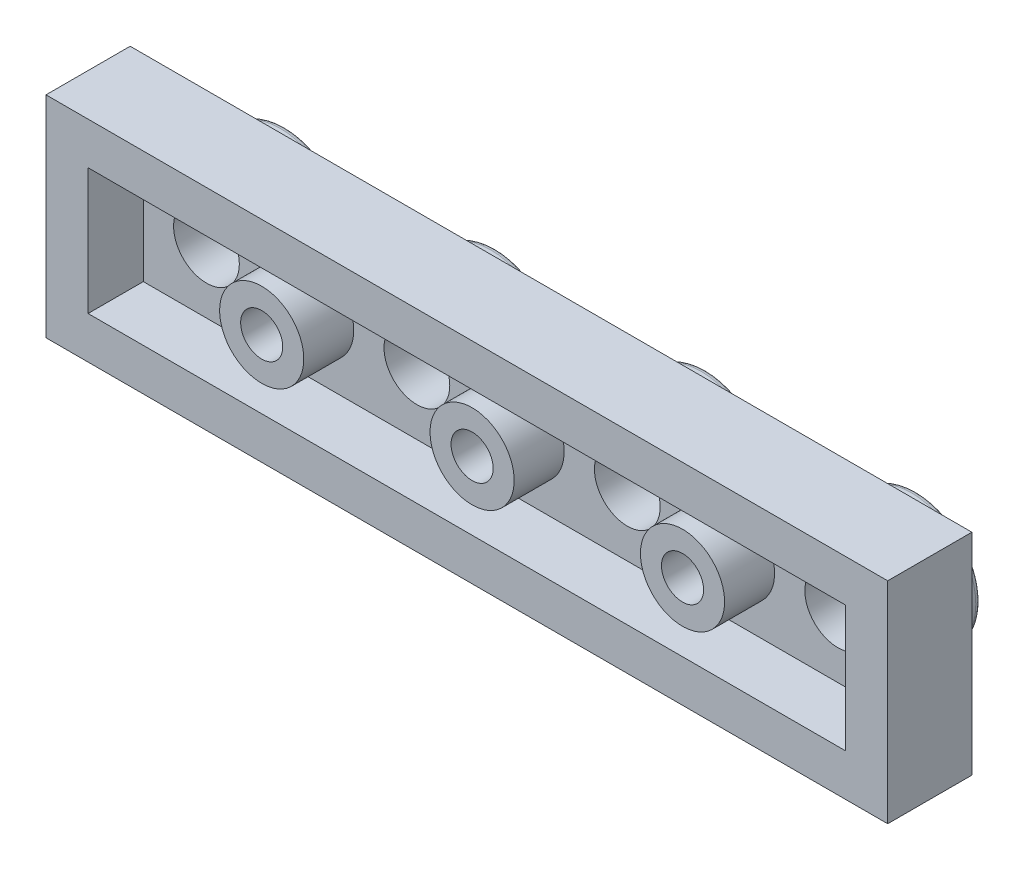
ISO-10303-21;
HEADER;
FILE_DESCRIPTION(('STEP AP214'),'2;1');
FILE_NAME('part.step','',(''),(''),'','','');
FILE_SCHEMA(('AUTOMOTIVE_DESIGN { 1 0 10303 214 1 1 1 1 }'));
ENDSEC;
DATA;
#1=APPLICATION_CONTEXT('core data for automotive mechanical design processes');
#2=APPLICATION_PROTOCOL_DEFINITION('international standard','automotive_design',2000,#1);
#3=PRODUCT_CONTEXT('',#1,'mechanical');
#4=PRODUCT('Part','Part','',(#3));
#5=PRODUCT_RELATED_PRODUCT_CATEGORY('part','',(#4));
#6=PRODUCT_DEFINITION_FORMATION('','',#4);
#7=PRODUCT_DEFINITION_CONTEXT('part definition',#1,'design');
#8=PRODUCT_DEFINITION('design','',#6,#7);
#9=PRODUCT_DEFINITION_SHAPE('','',#8);
#10=(LENGTH_UNIT() NAMED_UNIT(*) SI_UNIT(.MILLI.,.METRE.));
#11=(NAMED_UNIT(*) PLANE_ANGLE_UNIT() SI_UNIT($,.RADIAN.));
#12=(NAMED_UNIT(*) SI_UNIT($,.STERADIAN.) SOLID_ANGLE_UNIT());
#13=UNCERTAINTY_MEASURE_WITH_UNIT(LENGTH_MEASURE(1.E-05),#10,'distance_accuracy_value','');
#14=(GEOMETRIC_REPRESENTATION_CONTEXT(3) GLOBAL_UNCERTAINTY_ASSIGNED_CONTEXT((#13)) GLOBAL_UNIT_ASSIGNED_CONTEXT((#10,
#11,#12)) REPRESENTATION_CONTEXT('',''));
#15=CARTESIAN_POINT('',(0.,0.,0.));
#16=DIRECTION('',(0.,0.,1.));
#17=DIRECTION('',(1.,0.,0.));
#18=AXIS2_PLACEMENT_3D('',#15,#16,#17);
#19=CARTESIAN_POINT('',(0.,0.,0.));
#20=DIRECTION('',(0.,0.,-1.));
#21=DIRECTION('',(-1.,0.,0.));
#22=AXIS2_PLACEMENT_3D('',#19,#20,#21);
#23=PLANE('',#22);
#24=CARTESIAN_POINT('',(-4.,-4.,0.));
#25=DIRECTION('',(0.,0.,-1.));
#26=DIRECTION('',(-1.,0.,0.));
#27=AXIS2_PLACEMENT_3D('',#24,#25,#26);
#28=CIRCLE('',#27,2.45);
#29=CARTESIAN_POINT('',(-1.55,-4.,0.));
#30=VERTEX_POINT('',#29);
#31=EDGE_CURVE('E547',#30,#30,#28,.T.);
#32=ORIENTED_EDGE('',*,*,#31,.F.);
#33=EDGE_LOOP('',(#32));
#34=FACE_BOUND('',#33,.T.);
#35=DIRECTION('',(0.,1.,0.));
#36=VECTOR('',#35,1.);
#37=CARTESIAN_POINT('',(0.,0.,0.));
#38=LINE('',#37,#36);
#39=CARTESIAN_POINT('',(0.,-8.,0.));
#40=VERTEX_POINT('',#39);
#41=CARTESIAN_POINT('',(0.,0.,0.));
#42=VERTEX_POINT('',#41);
#43=EDGE_CURVE('E129',#40,#42,#38,.T.);
#44=ORIENTED_EDGE('',*,*,#43,.F.);
#45=DIRECTION('',(1.,0.,0.));
#46=VECTOR('',#45,1.);
#47=CARTESIAN_POINT('',(0.,-8.,0.));
#48=LINE('',#47,#46);
#49=CARTESIAN_POINT('',(-32.,-8.,0.));
#50=VERTEX_POINT('',#49);
#51=EDGE_CURVE('E138',#50,#40,#48,.T.);
#52=ORIENTED_EDGE('',*,*,#51,.F.);
#53=DIRECTION('',(0.,-1.,0.));
#54=VECTOR('',#53,1.);
#55=CARTESIAN_POINT('',(-32.,0.,0.));
#56=LINE('',#55,#54);
#57=CARTESIAN_POINT('',(-32.,0.,0.));
#58=VERTEX_POINT('',#57);
#59=EDGE_CURVE('E136',#58,#50,#56,.T.);
#60=ORIENTED_EDGE('',*,*,#59,.F.);
#61=DIRECTION('',(-1.,0.,0.));
#62=VECTOR('',#61,1.);
#63=CARTESIAN_POINT('',(0.,0.,0.));
#64=LINE('',#63,#62);
#65=EDGE_CURVE('E134',#42,#58,#64,.T.);
#66=ORIENTED_EDGE('',*,*,#65,.F.);
#67=EDGE_LOOP('',(#44,#52,#60,#66));
#68=FACE_BOUND('',#67,.T.);
#69=CARTESIAN_POINT('',(-12.,-4.,0.));
#70=DIRECTION('',(0.,0.,-1.));
#71=DIRECTION('',(-1.,0.,0.));
#72=AXIS2_PLACEMENT_3D('',#69,#70,#71);
#73=CIRCLE('',#72,2.45);
#74=CARTESIAN_POINT('',(-9.55,-4.,0.));
#75=VERTEX_POINT('',#74);
#76=EDGE_CURVE('E515',#75,#75,#73,.T.);
#77=ORIENTED_EDGE('',*,*,#76,.F.);
#78=EDGE_LOOP('',(#77));
#79=FACE_BOUND('',#78,.T.);
#80=CARTESIAN_POINT('',(-20.,-4.,0.));
#81=DIRECTION('',(0.,0.,-1.));
#82=DIRECTION('',(-1.,0.,0.));
#83=AXIS2_PLACEMENT_3D('',#80,#81,#82);
#84=CIRCLE('',#83,2.45);
#85=CARTESIAN_POINT('',(-17.55,-4.,0.));
#86=VERTEX_POINT('',#85);
#87=EDGE_CURVE('E174',#86,#86,#84,.T.);
#88=ORIENTED_EDGE('',*,*,#87,.F.);
#89=EDGE_LOOP('',(#88));
#90=FACE_BOUND('',#89,.T.);
#91=CARTESIAN_POINT('',(-28.,-4.,0.));
#92=DIRECTION('',(0.,0.,-1.));
#93=DIRECTION('',(-1.,0.,0.));
#94=AXIS2_PLACEMENT_3D('',#91,#92,#93);
#95=CIRCLE('',#94,2.45);
#96=CARTESIAN_POINT('',(-25.55,-4.,0.));
#97=VERTEX_POINT('',#96);
#98=EDGE_CURVE('E183',#97,#97,#95,.T.);
#99=ORIENTED_EDGE('',*,*,#98,.F.);
#100=EDGE_LOOP('',(#99));
#101=FACE_BOUND('',#100,.T.);
#102=ADVANCED_FACE('F26',(#34,#68,#79,#90,#101),#23,.T.);
#103=CARTESIAN_POINT('',(-1.6,-6.4,1.1));
#104=DIRECTION('',(0.,0.,1.));
#105=DIRECTION('',(1.,0.,0.));
#106=AXIS2_PLACEMENT_3D('',#103,#104,#105);
#107=PLANE('',#106);
#108=CARTESIAN_POINT('',(-28.,-4.00000000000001,1.1));
#109=DIRECTION('',(0.,0.,1.));
#110=DIRECTION('',(1.,0.,0.));
#111=AXIS2_PLACEMENT_3D('',#108,#109,#110);
#112=CIRCLE('',#111,1.25);
#113=CARTESIAN_POINT('',(-26.75,-4.00000000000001,1.1));
#114=VERTEX_POINT('',#113);
#115=EDGE_CURVE('E499',#114,#114,#112,.T.);
#116=ORIENTED_EDGE('',*,*,#115,.F.);
#117=EDGE_LOOP('',(#116));
#118=FACE_BOUND('',#117,.T.);
#119=CARTESIAN_POINT('',(-20.,-4.00000000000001,1.1));
#120=DIRECTION('',(0.,0.,1.));
#121=DIRECTION('',(1.,0.,0.));
#122=AXIS2_PLACEMENT_3D('',#119,#120,#121);
#123=CIRCLE('',#122,1.25);
#124=CARTESIAN_POINT('',(-18.75,-4.00000000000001,1.1));
#125=VERTEX_POINT('',#124);
#126=EDGE_CURVE('E498',#125,#125,#123,.T.);
#127=ORIENTED_EDGE('',*,*,#126,.F.);
#128=EDGE_LOOP('',(#127));
#129=FACE_BOUND('',#128,.T.);
#130=CARTESIAN_POINT('',(-12.,-4.,1.1));
#131=DIRECTION('',(0.,0.,1.));
#132=DIRECTION('',(1.,0.,0.));
#133=AXIS2_PLACEMENT_3D('',#130,#131,#132);
#134=CIRCLE('',#133,1.25);
#135=CARTESIAN_POINT('',(-10.75,-4.,1.1));
#136=VERTEX_POINT('',#135);
#137=EDGE_CURVE('E509',#136,#136,#134,.T.);
#138=ORIENTED_EDGE('',*,*,#137,.F.);
#139=EDGE_LOOP('',(#138));
#140=FACE_BOUND('',#139,.T.);
#141=CARTESIAN_POINT('',(-4.,-4.,1.1));
#142=DIRECTION('',(0.,0.,1.));
#143=DIRECTION('',(1.,0.,0.));
#144=AXIS2_PLACEMENT_3D('',#141,#142,#143);
#145=CIRCLE('',#144,1.25);
#146=CARTESIAN_POINT('',(-2.75,-4.,1.1));
#147=VERTEX_POINT('',#146);
#148=EDGE_CURVE('E541',#147,#147,#145,.T.);
#149=ORIENTED_EDGE('',*,*,#148,.F.);
#150=EDGE_LOOP('',(#149));
#151=FACE_BOUND('',#150,.T.);
#152=DIRECTION('',(0.,1.,0.));
#153=VECTOR('',#152,1.);
#154=CARTESIAN_POINT('',(-1.6,-6.4,1.1));
#155=LINE('',#154,#153);
#156=CARTESIAN_POINT('',(-1.6,-6.4,1.1));
#157=VERTEX_POINT('',#156);
#158=CARTESIAN_POINT('',(-1.6,-1.6,1.1));
#159=VERTEX_POINT('',#158);
#160=EDGE_CURVE('E115',#157,#159,#155,.T.);
#161=ORIENTED_EDGE('',*,*,#160,.T.);
#162=DIRECTION('',(-1.,0.,0.));
#163=VECTOR('',#162,1.);
#164=CARTESIAN_POINT('',(-1.6,-1.6,1.1));
#165=LINE('',#164,#163);
#166=CARTESIAN_POINT('',(-30.4,-1.60000000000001,1.1));
#167=VERTEX_POINT('',#166);
#168=EDGE_CURVE('E121',#159,#167,#165,.T.);
#169=ORIENTED_EDGE('',*,*,#168,.T.);
#170=DIRECTION('',(0.,-1.,0.));
#171=VECTOR('',#170,1.);
#172=CARTESIAN_POINT('',(-30.4,-6.40000000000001,1.1));
#173=LINE('',#172,#171);
#174=CARTESIAN_POINT('',(-30.4,-6.40000000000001,1.1));
#175=VERTEX_POINT('',#174);
#176=EDGE_CURVE('E99',#167,#175,#173,.T.);
#177=ORIENTED_EDGE('',*,*,#176,.T.);
#178=DIRECTION('',(1.,0.,0.));
#179=VECTOR('',#178,1.);
#180=CARTESIAN_POINT('',(-1.6,-6.4,1.1));
#181=LINE('',#180,#179);
#182=EDGE_CURVE('E124',#175,#157,#181,.T.);
#183=ORIENTED_EDGE('',*,*,#182,.T.);
#184=EDGE_LOOP('',(#161,#169,#177,#183));
#185=FACE_BOUND('',#184,.T.);
#186=CARTESIAN_POINT('',(-8.,-4.00000000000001,1.1));
#187=DIRECTION('',(0.,0.,1.));
#188=DIRECTION('',(1.,0.,0.));
#189=AXIS2_PLACEMENT_3D('',#186,#187,#188);
#190=CIRCLE('',#189,1.6);
#191=CARTESIAN_POINT('',(-9.6,-4.00000000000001,1.1));
#192=VERTEX_POINT('',#191);
#193=EDGE_CURVE('E553',#192,#192,#190,.T.);
#194=ORIENTED_EDGE('',*,*,#193,.F.);
#195=EDGE_LOOP('',(#194));
#196=FACE_BOUND('',#195,.T.);
#197=CARTESIAN_POINT('',(-16.,-4.00000000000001,1.1));
#198=DIRECTION('',(0.,0.,1.));
#199=DIRECTION('',(1.,0.,0.));
#200=AXIS2_PLACEMENT_3D('',#197,#198,#199);
#201=CIRCLE('',#200,1.6);
#202=CARTESIAN_POINT('',(-17.6,-4.00000000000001,1.1));
#203=VERTEX_POINT('',#202);
#204=EDGE_CURVE('E535',#203,#203,#201,.T.);
#205=ORIENTED_EDGE('',*,*,#204,.F.);
#206=EDGE_LOOP('',(#205));
#207=FACE_BOUND('',#206,.T.);
#208=CARTESIAN_POINT('',(-24.,-4.00000000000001,1.1));
#209=DIRECTION('',(0.,0.,1.));
#210=DIRECTION('',(1.,0.,0.));
#211=AXIS2_PLACEMENT_3D('',#208,#209,#210);
#212=CIRCLE('',#211,1.6);
#213=CARTESIAN_POINT('',(-25.6,-4.00000000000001,1.1));
#214=VERTEX_POINT('',#213);
#215=EDGE_CURVE('E526',#214,#214,#212,.T.);
#216=ORIENTED_EDGE('',*,*,#215,.F.);
#217=EDGE_LOOP('',(#216));
#218=FACE_BOUND('',#217,.T.);
#219=ADVANCED_FACE('F204',(#118,#129,#140,#151,#185,#196,#207,#218),#107,.T.);
#220=CARTESIAN_POINT('',(0.,0.,3.2));
#221=DIRECTION('',(-1.,0.,0.));
#222=DIRECTION('',(0.,-1.,0.));
#223=AXIS2_PLACEMENT_3D('',#220,#221,#222);
#224=PLANE('',#223);
#225=ORIENTED_EDGE('',*,*,#43,.T.);
#226=DIRECTION('',(0.,0.,-1.));
#227=VECTOR('',#226,1.);
#228=CARTESIAN_POINT('',(0.,0.,3.2));
#229=LINE('',#228,#227);
#230=CARTESIAN_POINT('',(0.,0.,3.2));
#231=VERTEX_POINT('',#230);
#232=EDGE_CURVE('E156',#231,#42,#229,.T.);
#233=ORIENTED_EDGE('',*,*,#232,.F.);
#234=DIRECTION('',(0.,1.,0.));
#235=VECTOR('',#234,1.);
#236=CARTESIAN_POINT('',(0.,0.,3.2));
#237=LINE('',#236,#235);
#238=CARTESIAN_POINT('',(0.,-8.,3.2));
#239=VERTEX_POINT('',#238);
#240=EDGE_CURVE('E140',#239,#231,#237,.T.);
#241=ORIENTED_EDGE('',*,*,#240,.F.);
#242=DIRECTION('',(0.,0.,-1.));
#243=VECTOR('',#242,1.);
#244=CARTESIAN_POINT('',(0.,-8.,3.2));
#245=LINE('',#244,#243);
#246=EDGE_CURVE('E147',#239,#40,#245,.T.);
#247=ORIENTED_EDGE('',*,*,#246,.T.);
#248=EDGE_LOOP('',(#225,#233,#241,#247));
#249=FACE_BOUND('',#248,.T.);
#250=ADVANCED_FACE('F211',(#249),#224,.F.);
#251=CARTESIAN_POINT('',(0.,0.,3.2));
#252=DIRECTION('',(0.,-1.,0.));
#253=DIRECTION('',(1.,0.,0.));
#254=AXIS2_PLACEMENT_3D('',#251,#252,#253);
#255=PLANE('',#254);
#256=ORIENTED_EDGE('',*,*,#65,.T.);
#257=DIRECTION('',(0.,0.,-1.));
#258=VECTOR('',#257,1.);
#259=CARTESIAN_POINT('',(-32.,0.,3.2));
#260=LINE('',#259,#258);
#261=CARTESIAN_POINT('',(-32.,0.,3.2));
#262=VERTEX_POINT('',#261);
#263=EDGE_CURVE('E153',#262,#58,#260,.T.);
#264=ORIENTED_EDGE('',*,*,#263,.F.);
#265=DIRECTION('',(-1.,0.,0.));
#266=VECTOR('',#265,1.);
#267=CARTESIAN_POINT('',(0.,0.,3.2));
#268=LINE('',#267,#266);
#269=EDGE_CURVE('E142',#231,#262,#268,.T.);
#270=ORIENTED_EDGE('',*,*,#269,.F.);
#271=ORIENTED_EDGE('',*,*,#232,.T.);
#272=EDGE_LOOP('',(#256,#264,#270,#271));
#273=FACE_BOUND('',#272,.T.);
#274=ADVANCED_FACE('F231',(#273),#255,.F.);
#275=CARTESIAN_POINT('',(-32.,0.,3.2));
#276=DIRECTION('',(1.,0.,0.));
#277=DIRECTION('',(0.,0.,-1.));
#278=AXIS2_PLACEMENT_3D('',#275,#276,#277);
#279=PLANE('',#278);
#280=ORIENTED_EDGE('',*,*,#59,.T.);
#281=DIRECTION('',(0.,0.,-1.));
#282=VECTOR('',#281,1.);
#283=CARTESIAN_POINT('',(-32.,-8.,3.2));
#284=LINE('',#283,#282);
#285=CARTESIAN_POINT('',(-32.,-8.,3.2));
#286=VERTEX_POINT('',#285);
#287=EDGE_CURVE('E150',#286,#50,#284,.T.);
#288=ORIENTED_EDGE('',*,*,#287,.F.);
#289=DIRECTION('',(0.,-1.,0.));
#290=VECTOR('',#289,1.);
#291=CARTESIAN_POINT('',(-32.,0.,3.2));
#292=LINE('',#291,#290);
#293=EDGE_CURVE('E144',#262,#286,#292,.T.);
#294=ORIENTED_EDGE('',*,*,#293,.F.);
#295=ORIENTED_EDGE('',*,*,#263,.T.);
#296=EDGE_LOOP('',(#280,#288,#294,#295));
#297=FACE_BOUND('',#296,.T.);
#298=ADVANCED_FACE('F227',(#297),#279,.F.);
#299=CARTESIAN_POINT('',(0.,-8.,3.2));
#300=DIRECTION('',(0.,1.,0.));
#301=DIRECTION('',(-1.,0.,0.));
#302=AXIS2_PLACEMENT_3D('',#299,#300,#301);
#303=PLANE('',#302);
#304=ORIENTED_EDGE('',*,*,#51,.T.);
#305=ORIENTED_EDGE('',*,*,#246,.F.);
#306=DIRECTION('',(1.,0.,0.));
#307=VECTOR('',#306,1.);
#308=CARTESIAN_POINT('',(0.,-8.,3.2));
#309=LINE('',#308,#307);
#310=EDGE_CURVE('E49',#286,#239,#309,.T.);
#311=ORIENTED_EDGE('',*,*,#310,.F.);
#312=ORIENTED_EDGE('',*,*,#287,.T.);
#313=EDGE_LOOP('',(#304,#305,#311,#312));
#314=FACE_BOUND('',#313,.T.);
#315=ADVANCED_FACE('F224',(#314),#303,.F.);
#316=CARTESIAN_POINT('',(0.,0.,3.2));
#317=DIRECTION('',(0.,0.,-1.));
#318=DIRECTION('',(-1.,0.,0.));
#319=AXIS2_PLACEMENT_3D('',#316,#317,#318);
#320=PLANE('',#319);
#321=DIRECTION('',(-1.,0.,0.));
#322=VECTOR('',#321,1.);
#323=CARTESIAN_POINT('',(-1.6,-1.6,3.2));
#324=LINE('',#323,#322);
#325=CARTESIAN_POINT('',(-1.6,-1.6,3.2));
#326=VERTEX_POINT('',#325);
#327=CARTESIAN_POINT('',(-30.4,-1.60000000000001,3.2));
#328=VERTEX_POINT('',#327);
#329=EDGE_CURVE('E107',#326,#328,#324,.T.);
#330=ORIENTED_EDGE('',*,*,#329,.F.);
#331=DIRECTION('',(0.,1.,0.));
#332=VECTOR('',#331,1.);
#333=CARTESIAN_POINT('',(-1.6,-6.4,3.2));
#334=LINE('',#333,#332);
#335=CARTESIAN_POINT('',(-1.6,-6.4,3.2));
#336=VERTEX_POINT('',#335);
#337=EDGE_CURVE('E41',#336,#326,#334,.T.);
#338=ORIENTED_EDGE('',*,*,#337,.F.);
#339=DIRECTION('',(1.,0.,0.));
#340=VECTOR('',#339,1.);
#341=CARTESIAN_POINT('',(-1.6,-6.4,3.2));
#342=LINE('',#341,#340);
#343=CARTESIAN_POINT('',(-30.4,-6.40000000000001,3.2));
#344=VERTEX_POINT('',#343);
#345=EDGE_CURVE('E113',#344,#336,#342,.T.);
#346=ORIENTED_EDGE('',*,*,#345,.F.);
#347=DIRECTION('',(0.,-1.,0.));
#348=VECTOR('',#347,1.);
#349=CARTESIAN_POINT('',(-30.4,-6.40000000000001,3.2));
#350=LINE('',#349,#348);
#351=EDGE_CURVE('E96',#328,#344,#350,.T.);
#352=ORIENTED_EDGE('',*,*,#351,.F.);
#353=EDGE_LOOP('',(#330,#338,#346,#352));
#354=FACE_BOUND('',#353,.T.);
#355=ORIENTED_EDGE('',*,*,#240,.T.);
#356=ORIENTED_EDGE('',*,*,#269,.T.);
#357=ORIENTED_EDGE('',*,*,#293,.T.);
#358=ORIENTED_EDGE('',*,*,#310,.T.);
#359=EDGE_LOOP('',(#355,#356,#357,#358));
#360=FACE_BOUND('',#359,.T.);
#361=ADVANCED_FACE('F111',(#354,#360),#320,.F.);
#362=CARTESIAN_POINT('',(-1.6,-6.4,1.1));
#363=DIRECTION('',(1.,0.,0.));
#364=DIRECTION('',(0.,0.,-1.));
#365=AXIS2_PLACEMENT_3D('',#362,#363,#364);
#366=PLANE('',#365);
#367=ORIENTED_EDGE('',*,*,#337,.T.);
#368=DIRECTION('',(0.,0.,1.));
#369=VECTOR('',#368,1.);
#370=CARTESIAN_POINT('',(-1.6,-1.6,1.1));
#371=LINE('',#370,#369);
#372=EDGE_CURVE('E104',#159,#326,#371,.T.);
#373=ORIENTED_EDGE('',*,*,#372,.F.);
#374=ORIENTED_EDGE('',*,*,#160,.F.);
#375=DIRECTION('',(0.,0.,1.));
#376=VECTOR('',#375,1.);
#377=CARTESIAN_POINT('',(-1.6,-6.4,1.1));
#378=LINE('',#377,#376);
#379=EDGE_CURVE('E127',#157,#336,#378,.T.);
#380=ORIENTED_EDGE('',*,*,#379,.T.);
#381=EDGE_LOOP('',(#367,#373,#374,#380));
#382=FACE_BOUND('',#381,.T.);
#383=ADVANCED_FACE('F220',(#382),#366,.F.);
#384=CARTESIAN_POINT('',(-1.6,-6.4,1.1));
#385=DIRECTION('',(0.,-1.,0.));
#386=DIRECTION('',(1.,0.,0.));
#387=AXIS2_PLACEMENT_3D('',#384,#385,#386);
#388=PLANE('',#387);
#389=ORIENTED_EDGE('',*,*,#345,.T.);
#390=ORIENTED_EDGE('',*,*,#379,.F.);
#391=ORIENTED_EDGE('',*,*,#182,.F.);
#392=DIRECTION('',(0.,0.,1.));
#393=VECTOR('',#392,1.);
#394=CARTESIAN_POINT('',(-30.4,-6.40000000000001,1.1));
#395=LINE('',#394,#393);
#396=EDGE_CURVE('E103',#175,#344,#395,.T.);
#397=ORIENTED_EDGE('',*,*,#396,.T.);
#398=EDGE_LOOP('',(#389,#390,#391,#397));
#399=FACE_BOUND('',#398,.T.);
#400=ADVANCED_FACE('F330',(#399),#388,.F.);
#401=CARTESIAN_POINT('',(-30.4,-6.40000000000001,1.1));
#402=DIRECTION('',(-1.,0.,0.));
#403=DIRECTION('',(0.,0.,1.));
#404=AXIS2_PLACEMENT_3D('',#401,#402,#403);
#405=PLANE('',#404);
#406=ORIENTED_EDGE('',*,*,#351,.T.);
#407=ORIENTED_EDGE('',*,*,#396,.F.);
#408=ORIENTED_EDGE('',*,*,#176,.F.);
#409=DIRECTION('',(0.,0.,1.));
#410=VECTOR('',#409,1.);
#411=CARTESIAN_POINT('',(-30.4,-1.60000000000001,1.1));
#412=LINE('',#411,#410);
#413=EDGE_CURVE('E92',#167,#328,#412,.T.);
#414=ORIENTED_EDGE('',*,*,#413,.T.);
#415=EDGE_LOOP('',(#406,#407,#408,#414));
#416=FACE_BOUND('',#415,.T.);
#417=ADVANCED_FACE('F94',(#416),#405,.F.);
#418=CARTESIAN_POINT('',(-1.6,-1.6,1.1));
#419=DIRECTION('',(0.,1.,0.));
#420=DIRECTION('',(-1.,0.,0.));
#421=AXIS2_PLACEMENT_3D('',#418,#419,#420);
#422=PLANE('',#421);
#423=ORIENTED_EDGE('',*,*,#329,.T.);
#424=ORIENTED_EDGE('',*,*,#413,.F.);
#425=ORIENTED_EDGE('',*,*,#168,.F.);
#426=ORIENTED_EDGE('',*,*,#372,.T.);
#427=EDGE_LOOP('',(#423,#424,#425,#426));
#428=FACE_BOUND('',#427,.T.);
#429=ADVANCED_FACE('F108',(#428),#422,.F.);
#430=CARTESIAN_POINT('',(-8.,-4.00000000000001,3.));
#431=DIRECTION('',(0.,0.,1.));
#432=DIRECTION('',(1.,0.,0.));
#433=AXIS2_PLACEMENT_3D('',#430,#431,#432);
#434=PLANE('',#433);
#435=CARTESIAN_POINT('',(-8.,-4.00000000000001,3.));
#436=DIRECTION('',(0.,0.,1.));
#437=DIRECTION('',(1.,0.,0.));
#438=AXIS2_PLACEMENT_3D('',#435,#436,#437);
#439=CIRCLE('',#438,1.6);
#440=CARTESIAN_POINT('',(-9.6,-4.00000000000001,3.));
#441=VERTEX_POINT('',#440);
#442=EDGE_CURVE('E556',#441,#441,#439,.T.);
#443=ORIENTED_EDGE('',*,*,#442,.T.);
#444=EDGE_LOOP('',(#443));
#445=FACE_BOUND('',#444,.T.);
#446=CARTESIAN_POINT('',(-8.,-4.00000000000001,3.));
#447=DIRECTION('',(0.,0.,1.));
#448=DIRECTION('',(1.,0.,0.));
#449=AXIS2_PLACEMENT_3D('',#446,#447,#448);
#450=CIRCLE('',#449,0.799999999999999);
#451=CARTESIAN_POINT('',(-8.8,-4.00000000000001,3.));
#452=VERTEX_POINT('',#451);
#453=EDGE_CURVE('E550',#452,#452,#450,.T.);
#454=ORIENTED_EDGE('',*,*,#453,.F.);
#455=EDGE_LOOP('',(#454));
#456=FACE_BOUND('',#455,.T.);
#457=ADVANCED_FACE('F321',(#445,#456),#434,.T.);
#458=CARTESIAN_POINT('',(-8.,-4.00000000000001,3.));
#459=DIRECTION('',(0.,0.,-1.));
#460=DIRECTION('',(-1.,0.,0.));
#461=AXIS2_PLACEMENT_3D('',#458,#459,#460);
#462=CYLINDRICAL_SURFACE('',#461,1.6);
#463=CARTESIAN_POINT('',(-9.6,-4.00000000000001,3.));
#464=CARTESIAN_POINT('',(-9.6,-4.00000000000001,2.98020833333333));
#465=CARTESIAN_POINT('',(-9.6,-4.00000000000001,2.96041666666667));
#466=CARTESIAN_POINT('',(-9.6,-4.00000000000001,2.92083333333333));
#467=CARTESIAN_POINT('',(-9.6,-4.00000000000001,2.90104166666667));
#468=CARTESIAN_POINT('',(-9.6,-4.00000000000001,2.86145833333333));
#469=CARTESIAN_POINT('',(-9.6,-4.00000000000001,2.84166666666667));
#470=CARTESIAN_POINT('',(-9.6,-4.00000000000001,2.80208333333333));
#471=CARTESIAN_POINT('',(-9.6,-4.00000000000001,2.78229166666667));
#472=CARTESIAN_POINT('',(-9.6,-4.00000000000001,2.74270833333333));
#473=CARTESIAN_POINT('',(-9.6,-4.00000000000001,2.72291666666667));
#474=CARTESIAN_POINT('',(-9.6,-4.00000000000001,2.68333333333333));
#475=CARTESIAN_POINT('',(-9.6,-4.00000000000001,2.66354166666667));
#476=CARTESIAN_POINT('',(-9.6,-4.00000000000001,2.62395833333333));
#477=CARTESIAN_POINT('',(-9.6,-4.00000000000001,2.60416666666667));
#478=CARTESIAN_POINT('',(-9.6,-4.00000000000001,2.56458333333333));
#479=CARTESIAN_POINT('',(-9.6,-4.00000000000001,2.54479166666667));
#480=CARTESIAN_POINT('',(-9.6,-4.00000000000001,2.50520833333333));
#481=CARTESIAN_POINT('',(-9.6,-4.00000000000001,2.48541666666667));
#482=CARTESIAN_POINT('',(-9.6,-4.00000000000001,2.44583333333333));
#483=CARTESIAN_POINT('',(-9.6,-4.00000000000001,2.42604166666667));
#484=CARTESIAN_POINT('',(-9.6,-4.00000000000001,2.38645833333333));
#485=CARTESIAN_POINT('',(-9.6,-4.00000000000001,2.36666666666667));
#486=CARTESIAN_POINT('',(-9.6,-4.00000000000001,2.32708333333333));
#487=CARTESIAN_POINT('',(-9.6,-4.00000000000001,2.30729166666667));
#488=CARTESIAN_POINT('',(-9.6,-4.00000000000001,2.26770833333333));
#489=CARTESIAN_POINT('',(-9.6,-4.00000000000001,2.24791666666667));
#490=CARTESIAN_POINT('',(-9.6,-4.00000000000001,2.20833333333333));
#491=CARTESIAN_POINT('',(-9.6,-4.00000000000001,2.18854166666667));
#492=CARTESIAN_POINT('',(-9.6,-4.00000000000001,2.14895833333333));
#493=CARTESIAN_POINT('',(-9.6,-4.00000000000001,2.12916666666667));
#494=CARTESIAN_POINT('',(-9.6,-4.00000000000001,2.08958333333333));
#495=CARTESIAN_POINT('',(-9.6,-4.00000000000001,2.06979166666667));
#496=CARTESIAN_POINT('',(-9.6,-4.00000000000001,2.03020833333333));
#497=CARTESIAN_POINT('',(-9.6,-4.00000000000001,2.01041666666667));
#498=CARTESIAN_POINT('',(-9.6,-4.00000000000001,1.97083333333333));
#499=CARTESIAN_POINT('',(-9.6,-4.00000000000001,1.95104166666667));
#500=CARTESIAN_POINT('',(-9.6,-4.00000000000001,1.91145833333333));
#501=CARTESIAN_POINT('',(-9.6,-4.00000000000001,1.89166666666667));
#502=CARTESIAN_POINT('',(-9.6,-4.00000000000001,1.85208333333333));
#503=CARTESIAN_POINT('',(-9.6,-4.00000000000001,1.83229166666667));
#504=CARTESIAN_POINT('',(-9.6,-4.00000000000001,1.79270833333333));
#505=CARTESIAN_POINT('',(-9.6,-4.00000000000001,1.77291666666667));
#506=CARTESIAN_POINT('',(-9.6,-4.00000000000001,1.73333333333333));
#507=CARTESIAN_POINT('',(-9.6,-4.00000000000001,1.71354166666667));
#508=CARTESIAN_POINT('',(-9.6,-4.00000000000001,1.67395833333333));
#509=CARTESIAN_POINT('',(-9.6,-4.00000000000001,1.65416666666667));
#510=CARTESIAN_POINT('',(-9.6,-4.00000000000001,1.61458333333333));
#511=CARTESIAN_POINT('',(-9.6,-4.00000000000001,1.59479166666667));
#512=CARTESIAN_POINT('',(-9.6,-4.00000000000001,1.55520833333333));
#513=CARTESIAN_POINT('',(-9.6,-4.00000000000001,1.53541666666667));
#514=CARTESIAN_POINT('',(-9.6,-4.00000000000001,1.49583333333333));
#515=CARTESIAN_POINT('',(-9.6,-4.00000000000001,1.47604166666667));
#516=CARTESIAN_POINT('',(-9.6,-4.00000000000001,1.43645833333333));
#517=CARTESIAN_POINT('',(-9.6,-4.00000000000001,1.41666666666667));
#518=CARTESIAN_POINT('',(-9.6,-4.00000000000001,1.37708333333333));
#519=CARTESIAN_POINT('',(-9.6,-4.00000000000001,1.35729166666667));
#520=CARTESIAN_POINT('',(-9.6,-4.00000000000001,1.31770833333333));
#521=CARTESIAN_POINT('',(-9.6,-4.00000000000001,1.29791666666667));
#522=CARTESIAN_POINT('',(-9.6,-4.00000000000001,1.25833333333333));
#523=CARTESIAN_POINT('',(-9.6,-4.00000000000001,1.23854166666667));
#524=CARTESIAN_POINT('',(-9.6,-4.00000000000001,1.19895833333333));
#525=CARTESIAN_POINT('',(-9.6,-4.00000000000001,1.17916666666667));
#526=CARTESIAN_POINT('',(-9.6,-4.00000000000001,1.13958333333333));
#527=CARTESIAN_POINT('',(-9.6,-4.00000000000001,1.11979166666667));
#528=CARTESIAN_POINT('',(-9.6,-4.00000000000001,1.1));
#529=B_SPLINE_CURVE_WITH_KNOTS('',3,(#463,#464,#465,#466,#467,#468,#469,#470,#471,#472,#473,
#474,#475,#476,#477,#478,#479,#480,#481,#482,#483,#484,#485,#486,#487,#488,#489,#490,#491,#492,
#493,#494,#495,#496,#497,#498,#499,#500,#501,#502,#503,#504,#505,#506,#507,#508,#509,#510,#511,
#512,#513,#514,#515,#516,#517,#518,#519,#520,#521,#522,#523,#524,#525,#526,#527,#528),
.UNSPECIFIED.,.F.,.F.,(4,2,2,2,2,2,2,2,2,2,2,2,2,2,2,2,2,2,2,2,2,2,2,2,2,2,2,2,2,2,2,2,4),(0.,
0.0593750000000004,0.11875,0.178125,0.2375,0.296875,0.35625,0.415625,0.475,0.534375,0.59375,
0.653125,0.7125,0.771875,0.83125,0.890625,0.95,1.009375,1.06875,1.128125,1.1875,1.246875,
1.30625,1.365625,1.425,1.484375,1.54375,1.603125,1.6625,1.721875,1.78125,1.840625,1.9),.UNSPECIFIED.);
#530=EDGE_CURVE('BSEAM319',#441,#192,#529,.T.);
#531=ORIENTED_EDGE('',*,*,#442,.F.);
#532=ORIENTED_EDGE('',*,*,#193,.T.);
#533=ORIENTED_EDGE('',*,*,#530,.T.);
#534=ORIENTED_EDGE('',*,*,#530,.F.);
#535=EDGE_LOOP('',(#531,#533,#532,#534));
#536=FACE_BOUND('',#535,.T.);
#537=ADVANCED_FACE('F319',(#536),#462,.T.);
#538=CARTESIAN_POINT('',(-8.,-4.00000000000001,3.));
#539=DIRECTION('',(0.,0.,-1.));
#540=DIRECTION('',(-1.,0.,0.));
#541=AXIS2_PLACEMENT_3D('',#538,#539,#540);
#542=CYLINDRICAL_SURFACE('',#541,0.799999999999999);
#543=CARTESIAN_POINT('',(-8.,-4.00000000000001,1.1));
#544=DIRECTION('',(0.,0.,1.));
#545=DIRECTION('',(1.,0.,0.));
#546=AXIS2_PLACEMENT_3D('',#543,#544,#545);
#547=CIRCLE('',#546,0.799999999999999);
#548=CARTESIAN_POINT('',(-8.8,-4.00000000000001,1.1));
#549=VERTEX_POINT('',#548);
#550=EDGE_CURVE('E159',#549,#549,#547,.F.);
#551=CARTESIAN_POINT('',(-8.8,-4.00000000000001,3.));
#552=CARTESIAN_POINT('',(-8.8,-4.00000000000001,2.98020833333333));
#553=CARTESIAN_POINT('',(-8.8,-4.00000000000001,2.96041666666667));
#554=CARTESIAN_POINT('',(-8.8,-4.00000000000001,2.92083333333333));
#555=CARTESIAN_POINT('',(-8.8,-4.00000000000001,2.90104166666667));
#556=CARTESIAN_POINT('',(-8.8,-4.00000000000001,2.86145833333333));
#557=CARTESIAN_POINT('',(-8.8,-4.00000000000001,2.84166666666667));
#558=CARTESIAN_POINT('',(-8.8,-4.00000000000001,2.80208333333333));
#559=CARTESIAN_POINT('',(-8.8,-4.00000000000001,2.78229166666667));
#560=CARTESIAN_POINT('',(-8.8,-4.00000000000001,2.74270833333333));
#561=CARTESIAN_POINT('',(-8.8,-4.00000000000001,2.72291666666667));
#562=CARTESIAN_POINT('',(-8.8,-4.00000000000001,2.68333333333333));
#563=CARTESIAN_POINT('',(-8.8,-4.00000000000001,2.66354166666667));
#564=CARTESIAN_POINT('',(-8.8,-4.00000000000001,2.62395833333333));
#565=CARTESIAN_POINT('',(-8.8,-4.00000000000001,2.60416666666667));
#566=CARTESIAN_POINT('',(-8.8,-4.00000000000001,2.56458333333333));
#567=CARTESIAN_POINT('',(-8.8,-4.00000000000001,2.54479166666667));
#568=CARTESIAN_POINT('',(-8.8,-4.00000000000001,2.50520833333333));
#569=CARTESIAN_POINT('',(-8.8,-4.00000000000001,2.48541666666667));
#570=CARTESIAN_POINT('',(-8.8,-4.00000000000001,2.44583333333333));
#571=CARTESIAN_POINT('',(-8.8,-4.00000000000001,2.42604166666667));
#572=CARTESIAN_POINT('',(-8.8,-4.00000000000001,2.38645833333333));
#573=CARTESIAN_POINT('',(-8.8,-4.00000000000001,2.36666666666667));
#574=CARTESIAN_POINT('',(-8.8,-4.00000000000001,2.32708333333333));
#575=CARTESIAN_POINT('',(-8.8,-4.00000000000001,2.30729166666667));
#576=CARTESIAN_POINT('',(-8.8,-4.00000000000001,2.26770833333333));
#577=CARTESIAN_POINT('',(-8.8,-4.00000000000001,2.24791666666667));
#578=CARTESIAN_POINT('',(-8.8,-4.00000000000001,2.20833333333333));
#579=CARTESIAN_POINT('',(-8.8,-4.00000000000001,2.18854166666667));
#580=CARTESIAN_POINT('',(-8.8,-4.00000000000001,2.14895833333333));
#581=CARTESIAN_POINT('',(-8.8,-4.00000000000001,2.12916666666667));
#582=CARTESIAN_POINT('',(-8.8,-4.00000000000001,2.08958333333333));
#583=CARTESIAN_POINT('',(-8.8,-4.00000000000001,2.06979166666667));
#584=CARTESIAN_POINT('',(-8.8,-4.00000000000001,2.03020833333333));
#585=CARTESIAN_POINT('',(-8.8,-4.00000000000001,2.01041666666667));
#586=CARTESIAN_POINT('',(-8.8,-4.00000000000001,1.97083333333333));
#587=CARTESIAN_POINT('',(-8.8,-4.00000000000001,1.95104166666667));
#588=CARTESIAN_POINT('',(-8.8,-4.00000000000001,1.91145833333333));
#589=CARTESIAN_POINT('',(-8.8,-4.00000000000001,1.89166666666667));
#590=CARTESIAN_POINT('',(-8.8,-4.00000000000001,1.85208333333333));
#591=CARTESIAN_POINT('',(-8.8,-4.00000000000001,1.83229166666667));
#592=CARTESIAN_POINT('',(-8.8,-4.00000000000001,1.79270833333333));
#593=CARTESIAN_POINT('',(-8.8,-4.00000000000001,1.77291666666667));
#594=CARTESIAN_POINT('',(-8.8,-4.00000000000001,1.73333333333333));
#595=CARTESIAN_POINT('',(-8.8,-4.00000000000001,1.71354166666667));
#596=CARTESIAN_POINT('',(-8.8,-4.00000000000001,1.67395833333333));
#597=CARTESIAN_POINT('',(-8.8,-4.00000000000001,1.65416666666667));
#598=CARTESIAN_POINT('',(-8.8,-4.00000000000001,1.61458333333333));
#599=CARTESIAN_POINT('',(-8.8,-4.00000000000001,1.59479166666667));
#600=CARTESIAN_POINT('',(-8.8,-4.00000000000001,1.55520833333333));
#601=CARTESIAN_POINT('',(-8.8,-4.00000000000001,1.53541666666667));
#602=CARTESIAN_POINT('',(-8.8,-4.00000000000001,1.49583333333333));
#603=CARTESIAN_POINT('',(-8.8,-4.00000000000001,1.47604166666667));
#604=CARTESIAN_POINT('',(-8.8,-4.00000000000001,1.43645833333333));
#605=CARTESIAN_POINT('',(-8.8,-4.00000000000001,1.41666666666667));
#606=CARTESIAN_POINT('',(-8.8,-4.00000000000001,1.37708333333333));
#607=CARTESIAN_POINT('',(-8.8,-4.00000000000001,1.35729166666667));
#608=CARTESIAN_POINT('',(-8.8,-4.00000000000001,1.31770833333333));
#609=CARTESIAN_POINT('',(-8.8,-4.00000000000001,1.29791666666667));
#610=CARTESIAN_POINT('',(-8.8,-4.00000000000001,1.25833333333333));
#611=CARTESIAN_POINT('',(-8.8,-4.00000000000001,1.23854166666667));
#612=CARTESIAN_POINT('',(-8.8,-4.00000000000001,1.19895833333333));
#613=CARTESIAN_POINT('',(-8.8,-4.00000000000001,1.17916666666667));
#614=CARTESIAN_POINT('',(-8.8,-4.00000000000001,1.13958333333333));
#615=CARTESIAN_POINT('',(-8.8,-4.00000000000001,1.11979166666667));
#616=CARTESIAN_POINT('',(-8.8,-4.00000000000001,1.1));
#617=B_SPLINE_CURVE_WITH_KNOTS('',3,(#551,#552,#553,#554,#555,#556,#557,#558,#559,#560,#561,
#562,#563,#564,#565,#566,#567,#568,#569,#570,#571,#572,#573,#574,#575,#576,#577,#578,#579,#580,
#581,#582,#583,#584,#585,#586,#587,#588,#589,#590,#591,#592,#593,#594,#595,#596,#597,#598,#599,
#600,#601,#602,#603,#604,#605,#606,#607,#608,#609,#610,#611,#612,#613,#614,#615,#616),
.UNSPECIFIED.,.F.,.F.,(4,2,2,2,2,2,2,2,2,2,2,2,2,2,2,2,2,2,2,2,2,2,2,2,2,2,2,2,2,2,2,2,4),(0.,
0.0593750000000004,0.11875,0.178125,0.2375,0.296875,0.35625,0.415625,0.475,0.534375,0.59375,
0.653125,0.7125,0.771875,0.83125,0.890625,0.95,1.009375,1.06875,1.128125,1.1875,1.246875,
1.30625,1.365625,1.425,1.484375,1.54375,1.603125,1.6625,1.721875,1.78125,1.840625,1.9),.UNSPECIFIED.);
#618=EDGE_CURVE('BSEAM316',#452,#549,#617,.T.);
#619=ORIENTED_EDGE('',*,*,#453,.T.);
#620=ORIENTED_EDGE('',*,*,#550,.T.);
#621=ORIENTED_EDGE('',*,*,#618,.T.);
#622=ORIENTED_EDGE('',*,*,#618,.F.);
#623=EDGE_LOOP('',(#619,#621,#620,#622));
#624=FACE_BOUND('',#623,.T.);
#625=ADVANCED_FACE('F316',(#624),#542,.F.);
#626=ORIENTED_EDGE('',*,*,#550,.F.);
#627=EDGE_LOOP('',(#626));
#628=FACE_BOUND('',#627,.T.);
#629=ADVANCED_FACE('F215',(#628),#107,.T.);
#630=CARTESIAN_POINT('',(-4.,-4.,-1.9));
#631=DIRECTION('',(0.,0.,1.));
#632=DIRECTION('',(1.,0.,0.));
#633=AXIS2_PLACEMENT_3D('',#630,#631,#632);
#634=CYLINDRICAL_SURFACE('',#633,2.45);
#635=CARTESIAN_POINT('',(-4.,-4.,-1.7));
#636=DIRECTION('',(0.,0.,-1.));
#637=DIRECTION('',(-1.,0.,0.));
#638=AXIS2_PLACEMENT_3D('',#635,#636,#637);
#639=CIRCLE('',#638,2.45);
#640=CARTESIAN_POINT('',(-1.55,-4.,-1.7));
#641=VERTEX_POINT('',#640);
#642=EDGE_CURVE('E165',#641,#641,#639,.F.);
#643=CARTESIAN_POINT('',(-1.55,-4.,-1.7));
#644=CARTESIAN_POINT('',(-1.55,-4.,-1.68229166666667));
#645=CARTESIAN_POINT('',(-1.55,-4.,-1.66458333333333));
#646=CARTESIAN_POINT('',(-1.55,-4.,-1.62916666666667));
#647=CARTESIAN_POINT('',(-1.55,-4.,-1.61145833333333));
#648=CARTESIAN_POINT('',(-1.55,-4.,-1.57604166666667));
#649=CARTESIAN_POINT('',(-1.55,-4.,-1.55833333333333));
#650=CARTESIAN_POINT('',(-1.55,-4.,-1.52291666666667));
#651=CARTESIAN_POINT('',(-1.55,-4.,-1.50520833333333));
#652=CARTESIAN_POINT('',(-1.55,-4.,-1.46979166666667));
#653=CARTESIAN_POINT('',(-1.55,-4.,-1.45208333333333));
#654=CARTESIAN_POINT('',(-1.55,-4.,-1.41666666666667));
#655=CARTESIAN_POINT('',(-1.55,-4.,-1.39895833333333));
#656=CARTESIAN_POINT('',(-1.55,-4.,-1.36354166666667));
#657=CARTESIAN_POINT('',(-1.55,-4.,-1.34583333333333));
#658=CARTESIAN_POINT('',(-1.55,-4.,-1.31041666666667));
#659=CARTESIAN_POINT('',(-1.55,-4.,-1.29270833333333));
#660=CARTESIAN_POINT('',(-1.55,-4.,-1.25729166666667));
#661=CARTESIAN_POINT('',(-1.55,-4.,-1.23958333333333));
#662=CARTESIAN_POINT('',(-1.55,-4.,-1.20416666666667));
#663=CARTESIAN_POINT('',(-1.55,-4.,-1.18645833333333));
#664=CARTESIAN_POINT('',(-1.55,-4.,-1.15104166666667));
#665=CARTESIAN_POINT('',(-1.55,-4.,-1.13333333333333));
#666=CARTESIAN_POINT('',(-1.55,-4.,-1.09791666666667));
#667=CARTESIAN_POINT('',(-1.55,-4.,-1.08020833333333));
#668=CARTESIAN_POINT('',(-1.55,-4.,-1.04479166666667));
#669=CARTESIAN_POINT('',(-1.55,-4.,-1.02708333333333));
#670=CARTESIAN_POINT('',(-1.55,-4.,-0.991666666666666));
#671=CARTESIAN_POINT('',(-1.55,-4.,-0.973958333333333));
#672=CARTESIAN_POINT('',(-1.55,-4.,-0.938541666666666));
#673=CARTESIAN_POINT('',(-1.55,-4.,-0.920833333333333));
#674=CARTESIAN_POINT('',(-1.55,-4.,-0.885416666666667));
#675=CARTESIAN_POINT('',(-1.55,-4.,-0.867708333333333));
#676=CARTESIAN_POINT('',(-1.55,-4.,-0.832291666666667));
#677=CARTESIAN_POINT('',(-1.55,-4.,-0.814583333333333));
#678=CARTESIAN_POINT('',(-1.55,-4.,-0.779166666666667));
#679=CARTESIAN_POINT('',(-1.55,-4.,-0.761458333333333));
#680=CARTESIAN_POINT('',(-1.55,-4.,-0.726041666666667));
#681=CARTESIAN_POINT('',(-1.55,-4.,-0.708333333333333));
#682=CARTESIAN_POINT('',(-1.55,-4.,-0.672916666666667));
#683=CARTESIAN_POINT('',(-1.55,-4.,-0.655208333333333));
#684=CARTESIAN_POINT('',(-1.55,-4.,-0.619791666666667));
#685=CARTESIAN_POINT('',(-1.55,-4.,-0.602083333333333));
#686=CARTESIAN_POINT('',(-1.55,-4.,-0.566666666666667));
#687=CARTESIAN_POINT('',(-1.55,-4.,-0.548958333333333));
#688=CARTESIAN_POINT('',(-1.55,-4.,-0.513541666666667));
#689=CARTESIAN_POINT('',(-1.55,-4.,-0.495833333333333));
#690=CARTESIAN_POINT('',(-1.55,-4.,-0.460416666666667));
#691=CARTESIAN_POINT('',(-1.55,-4.,-0.442708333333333));
#692=CARTESIAN_POINT('',(-1.55,-4.,-0.407291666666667));
#693=CARTESIAN_POINT('',(-1.55,-4.,-0.389583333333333));
#694=CARTESIAN_POINT('',(-1.55,-4.,-0.354166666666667));
#695=CARTESIAN_POINT('',(-1.55,-4.,-0.336458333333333));
#696=CARTESIAN_POINT('',(-1.55,-4.,-0.301041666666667));
#697=CARTESIAN_POINT('',(-1.55,-4.,-0.283333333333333));
#698=CARTESIAN_POINT('',(-1.55,-4.,-0.247916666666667));
#699=CARTESIAN_POINT('',(-1.55,-4.,-0.230208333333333));
#700=CARTESIAN_POINT('',(-1.55,-4.,-0.194791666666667));
#701=CARTESIAN_POINT('',(-1.55,-4.,-0.177083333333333));
#702=CARTESIAN_POINT('',(-1.55,-4.,-0.141666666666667));
#703=CARTESIAN_POINT('',(-1.55,-4.,-0.123958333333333));
#704=CARTESIAN_POINT('',(-1.55,-4.,-0.0885416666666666));
#705=CARTESIAN_POINT('',(-1.55,-4.,-0.0708333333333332));
#706=CARTESIAN_POINT('',(-1.55,-4.,-0.0354166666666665));
#707=CARTESIAN_POINT('',(-1.55,-4.,-0.0177083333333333));
#708=CARTESIAN_POINT('',(-1.55,-4.,0.));
#709=B_SPLINE_CURVE_WITH_KNOTS('',3,(#643,#644,#645,#646,#647,#648,#649,#650,#651,#652,#653,
#654,#655,#656,#657,#658,#659,#660,#661,#662,#663,#664,#665,#666,#667,#668,#669,#670,#671,#672,
#673,#674,#675,#676,#677,#678,#679,#680,#681,#682,#683,#684,#685,#686,#687,#688,#689,#690,#691,
#692,#693,#694,#695,#696,#697,#698,#699,#700,#701,#702,#703,#704,#705,#706,#707,#708),
.UNSPECIFIED.,.F.,.F.,(4,2,2,2,2,2,2,2,2,2,2,2,2,2,2,2,2,2,2,2,2,2,2,2,2,2,2,2,2,2,2,2,4),(0.,
0.053125,0.10625,0.159375,0.2125,0.265625,0.31875,0.371875,0.425,0.478125,0.53125,0.584375,
0.6375,0.690625,0.74375,0.796875,0.85,0.903125,0.95625,1.009375,1.0625,1.115625,1.16875,
1.221875,1.275,1.328125,1.38125,1.434375,1.4875,1.540625,1.59375,1.646875,1.7),.UNSPECIFIED.);
#710=EDGE_CURVE('BSEAM311',#641,#30,#709,.T.);
#711=ORIENTED_EDGE('',*,*,#642,.T.);
#712=ORIENTED_EDGE('',*,*,#31,.T.);
#713=ORIENTED_EDGE('',*,*,#710,.T.);
#714=ORIENTED_EDGE('',*,*,#710,.F.);
#715=EDGE_LOOP('',(#711,#713,#712,#714));
#716=FACE_BOUND('',#715,.T.);
#717=ADVANCED_FACE('F311',(#716),#634,.T.);
#718=CARTESIAN_POINT('',(-4.,-4.,-1.9));
#719=DIRECTION('',(0.,0.,-1.));
#720=DIRECTION('',(-1.,0.,0.));
#721=AXIS2_PLACEMENT_3D('',#718,#719,#720);
#722=PLANE('',#721);
#723=CARTESIAN_POINT('',(-4.,-4.,-1.9));
#724=DIRECTION('',(0.,0.,-1.));
#725=DIRECTION('',(-1.,0.,0.));
#726=AXIS2_PLACEMENT_3D('',#723,#724,#725);
#727=CIRCLE('',#726,2.25);
#728=CARTESIAN_POINT('',(-6.25,-4.,-1.9));
#729=VERTEX_POINT('',#728);
#730=EDGE_CURVE('E162',#729,#729,#727,.T.);
#731=ORIENTED_EDGE('',*,*,#730,.T.);
#732=EDGE_LOOP('',(#731));
#733=FACE_BOUND('',#732,.T.);
#734=ADVANCED_FACE('F307',(#733),#722,.T.);
#735=CARTESIAN_POINT('',(-4.,-4.,-1.7));
#736=DIRECTION('',(0.,0.,-1.));
#737=DIRECTION('',(-1.,0.,0.));
#738=AXIS2_PLACEMENT_3D('',#735,#736,#737);
#739=TOROIDAL_SURFACE('',#738,2.25,0.2);
#740=ORIENTED_EDGE('',*,*,#642,.F.);
#741=EDGE_LOOP('',(#740));
#742=FACE_BOUND('',#741,.T.);
#743=ORIENTED_EDGE('',*,*,#730,.F.);
#744=EDGE_LOOP('',(#743));
#745=FACE_BOUND('',#744,.T.);
#746=ADVANCED_FACE('F303',(#742,#745),#739,.T.);
#747=CARTESIAN_POINT('',(-4.,-4.,-0.7));
#748=DIRECTION('',(0.,0.,1.));
#749=DIRECTION('',(1.,0.,0.));
#750=AXIS2_PLACEMENT_3D('',#747,#748,#749);
#751=CYLINDRICAL_SURFACE('',#750,1.25);
#752=CARTESIAN_POINT('',(-4.,-4.,-0.7));
#753=DIRECTION('',(0.,0.,1.));
#754=DIRECTION('',(1.,0.,0.));
#755=AXIS2_PLACEMENT_3D('',#752,#753,#754);
#756=CIRCLE('',#755,1.25);
#757=CARTESIAN_POINT('',(-2.75,-4.,-0.7));
#758=VERTEX_POINT('',#757);
#759=EDGE_CURVE('E544',#758,#758,#756,.T.);
#760=ORIENTED_EDGE('',*,*,#759,.F.);
#761=EDGE_LOOP('',(#760));
#762=FACE_BOUND('',#761,.T.);
#763=ORIENTED_EDGE('',*,*,#148,.T.);
#764=EDGE_LOOP('',(#763));
#765=FACE_BOUND('',#764,.T.);
#766=ADVANCED_FACE('F299',(#762,#765),#751,.F.);
#767=CARTESIAN_POINT('',(-4.,-4.,-0.7));
#768=DIRECTION('',(0.,0.,1.));
#769=DIRECTION('',(1.,0.,0.));
#770=AXIS2_PLACEMENT_3D('',#767,#768,#769);
#771=PLANE('',#770);
#772=ORIENTED_EDGE('',*,*,#759,.T.);
#773=EDGE_LOOP('',(#772));
#774=FACE_BOUND('',#773,.T.);
#775=ADVANCED_FACE('F292',(#774),#771,.T.);
#776=CARTESIAN_POINT('',(-16.,-4.00000000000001,3.));
#777=DIRECTION('',(0.,0.,1.));
#778=DIRECTION('',(1.,0.,0.));
#779=AXIS2_PLACEMENT_3D('',#776,#777,#778);
#780=PLANE('',#779);
#781=CARTESIAN_POINT('',(-16.,-4.00000000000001,3.));
#782=DIRECTION('',(0.,0.,1.));
#783=DIRECTION('',(1.,0.,0.));
#784=AXIS2_PLACEMENT_3D('',#781,#782,#783);
#785=CIRCLE('',#784,1.6);
#786=CARTESIAN_POINT('',(-17.6,-4.00000000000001,3.));
#787=VERTEX_POINT('',#786);
#788=EDGE_CURVE('E538',#787,#787,#785,.T.);
#789=ORIENTED_EDGE('',*,*,#788,.T.);
#790=EDGE_LOOP('',(#789));
#791=FACE_BOUND('',#790,.T.);
#792=CARTESIAN_POINT('',(-16.,-4.00000000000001,3.));
#793=DIRECTION('',(0.,0.,1.));
#794=DIRECTION('',(1.,0.,0.));
#795=AXIS2_PLACEMENT_3D('',#792,#793,#794);
#796=CIRCLE('',#795,0.799999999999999);
#797=CARTESIAN_POINT('',(-16.8,-4.00000000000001,3.));
#798=VERTEX_POINT('',#797);
#799=EDGE_CURVE('E532',#798,#798,#796,.T.);
#800=ORIENTED_EDGE('',*,*,#799,.F.);
#801=EDGE_LOOP('',(#800));
#802=FACE_BOUND('',#801,.T.);
#803=ADVANCED_FACE('F289',(#791,#802),#780,.T.);
#804=CARTESIAN_POINT('',(-16.,-4.00000000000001,3.));
#805=DIRECTION('',(0.,0.,-1.));
#806=DIRECTION('',(-1.,0.,0.));
#807=AXIS2_PLACEMENT_3D('',#804,#805,#806);
#808=CYLINDRICAL_SURFACE('',#807,1.6);
#809=CARTESIAN_POINT('',(-17.6,-4.00000000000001,3.));
#810=CARTESIAN_POINT('',(-17.6,-4.00000000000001,2.98020833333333));
#811=CARTESIAN_POINT('',(-17.6,-4.00000000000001,2.96041666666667));
#812=CARTESIAN_POINT('',(-17.6,-4.00000000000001,2.92083333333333));
#813=CARTESIAN_POINT('',(-17.6,-4.00000000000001,2.90104166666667));
#814=CARTESIAN_POINT('',(-17.6,-4.00000000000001,2.86145833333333));
#815=CARTESIAN_POINT('',(-17.6,-4.00000000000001,2.84166666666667));
#816=CARTESIAN_POINT('',(-17.6,-4.00000000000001,2.80208333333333));
#817=CARTESIAN_POINT('',(-17.6,-4.00000000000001,2.78229166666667));
#818=CARTESIAN_POINT('',(-17.6,-4.00000000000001,2.74270833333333));
#819=CARTESIAN_POINT('',(-17.6,-4.00000000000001,2.72291666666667));
#820=CARTESIAN_POINT('',(-17.6,-4.00000000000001,2.68333333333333));
#821=CARTESIAN_POINT('',(-17.6,-4.00000000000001,2.66354166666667));
#822=CARTESIAN_POINT('',(-17.6,-4.00000000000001,2.62395833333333));
#823=CARTESIAN_POINT('',(-17.6,-4.00000000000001,2.60416666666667));
#824=CARTESIAN_POINT('',(-17.6,-4.00000000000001,2.56458333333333));
#825=CARTESIAN_POINT('',(-17.6,-4.00000000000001,2.54479166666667));
#826=CARTESIAN_POINT('',(-17.6,-4.00000000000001,2.50520833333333));
#827=CARTESIAN_POINT('',(-17.6,-4.00000000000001,2.48541666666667));
#828=CARTESIAN_POINT('',(-17.6,-4.00000000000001,2.44583333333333));
#829=CARTESIAN_POINT('',(-17.6,-4.00000000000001,2.42604166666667));
#830=CARTESIAN_POINT('',(-17.6,-4.00000000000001,2.38645833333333));
#831=CARTESIAN_POINT('',(-17.6,-4.00000000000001,2.36666666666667));
#832=CARTESIAN_POINT('',(-17.6,-4.00000000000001,2.32708333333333));
#833=CARTESIAN_POINT('',(-17.6,-4.00000000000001,2.30729166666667));
#834=CARTESIAN_POINT('',(-17.6,-4.00000000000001,2.26770833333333));
#835=CARTESIAN_POINT('',(-17.6,-4.00000000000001,2.24791666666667));
#836=CARTESIAN_POINT('',(-17.6,-4.00000000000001,2.20833333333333));
#837=CARTESIAN_POINT('',(-17.6,-4.00000000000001,2.18854166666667));
#838=CARTESIAN_POINT('',(-17.6,-4.00000000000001,2.14895833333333));
#839=CARTESIAN_POINT('',(-17.6,-4.00000000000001,2.12916666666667));
#840=CARTESIAN_POINT('',(-17.6,-4.00000000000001,2.08958333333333));
#841=CARTESIAN_POINT('',(-17.6,-4.00000000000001,2.06979166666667));
#842=CARTESIAN_POINT('',(-17.6,-4.00000000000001,2.03020833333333));
#843=CARTESIAN_POINT('',(-17.6,-4.00000000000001,2.01041666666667));
#844=CARTESIAN_POINT('',(-17.6,-4.00000000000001,1.97083333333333));
#845=CARTESIAN_POINT('',(-17.6,-4.00000000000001,1.95104166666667));
#846=CARTESIAN_POINT('',(-17.6,-4.00000000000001,1.91145833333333));
#847=CARTESIAN_POINT('',(-17.6,-4.00000000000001,1.89166666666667));
#848=CARTESIAN_POINT('',(-17.6,-4.00000000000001,1.85208333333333));
#849=CARTESIAN_POINT('',(-17.6,-4.00000000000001,1.83229166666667));
#850=CARTESIAN_POINT('',(-17.6,-4.00000000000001,1.79270833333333));
#851=CARTESIAN_POINT('',(-17.6,-4.00000000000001,1.77291666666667));
#852=CARTESIAN_POINT('',(-17.6,-4.00000000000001,1.73333333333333));
#853=CARTESIAN_POINT('',(-17.6,-4.00000000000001,1.71354166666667));
#854=CARTESIAN_POINT('',(-17.6,-4.00000000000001,1.67395833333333));
#855=CARTESIAN_POINT('',(-17.6,-4.00000000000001,1.65416666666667));
#856=CARTESIAN_POINT('',(-17.6,-4.00000000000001,1.61458333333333));
#857=CARTESIAN_POINT('',(-17.6,-4.00000000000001,1.59479166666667));
#858=CARTESIAN_POINT('',(-17.6,-4.00000000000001,1.55520833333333));
#859=CARTESIAN_POINT('',(-17.6,-4.00000000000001,1.53541666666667));
#860=CARTESIAN_POINT('',(-17.6,-4.00000000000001,1.49583333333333));
#861=CARTESIAN_POINT('',(-17.6,-4.00000000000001,1.47604166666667));
#862=CARTESIAN_POINT('',(-17.6,-4.00000000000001,1.43645833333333));
#863=CARTESIAN_POINT('',(-17.6,-4.00000000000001,1.41666666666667));
#864=CARTESIAN_POINT('',(-17.6,-4.00000000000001,1.37708333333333));
#865=CARTESIAN_POINT('',(-17.6,-4.00000000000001,1.35729166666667));
#866=CARTESIAN_POINT('',(-17.6,-4.00000000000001,1.31770833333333));
#867=CARTESIAN_POINT('',(-17.6,-4.00000000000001,1.29791666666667));
#868=CARTESIAN_POINT('',(-17.6,-4.00000000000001,1.25833333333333));
#869=CARTESIAN_POINT('',(-17.6,-4.00000000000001,1.23854166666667));
#870=CARTESIAN_POINT('',(-17.6,-4.00000000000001,1.19895833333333));
#871=CARTESIAN_POINT('',(-17.6,-4.00000000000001,1.17916666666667));
#872=CARTESIAN_POINT('',(-17.6,-4.00000000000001,1.13958333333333));
#873=CARTESIAN_POINT('',(-17.6,-4.00000000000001,1.11979166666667));
#874=CARTESIAN_POINT('',(-17.6,-4.00000000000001,1.1));
#875=B_SPLINE_CURVE_WITH_KNOTS('',3,(#809,#810,#811,#812,#813,#814,#815,#816,#817,#818,#819,
#820,#821,#822,#823,#824,#825,#826,#827,#828,#829,#830,#831,#832,#833,#834,#835,#836,#837,#838,
#839,#840,#841,#842,#843,#844,#845,#846,#847,#848,#849,#850,#851,#852,#853,#854,#855,#856,#857,
#858,#859,#860,#861,#862,#863,#864,#865,#866,#867,#868,#869,#870,#871,#872,#873,#874),
.UNSPECIFIED.,.F.,.F.,(4,2,2,2,2,2,2,2,2,2,2,2,2,2,2,2,2,2,2,2,2,2,2,2,2,2,2,2,2,2,2,2,4),(0.,
0.0593750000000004,0.11875,0.178125,0.2375,0.296875,0.35625,0.415625,0.475,0.534375,0.59375,
0.653125,0.7125,0.771875,0.83125,0.890625,0.95,1.009375,1.06875,1.128125,1.1875,1.246875,
1.30625,1.365625,1.425,1.484375,1.54375,1.603125,1.6625,1.721875,1.78125,1.840625,1.9),.UNSPECIFIED.);
#876=EDGE_CURVE('BSEAM287',#787,#203,#875,.T.);
#877=ORIENTED_EDGE('',*,*,#788,.F.);
#878=ORIENTED_EDGE('',*,*,#204,.T.);
#879=ORIENTED_EDGE('',*,*,#876,.T.);
#880=ORIENTED_EDGE('',*,*,#876,.F.);
#881=EDGE_LOOP('',(#877,#879,#878,#880));
#882=FACE_BOUND('',#881,.T.);
#883=ADVANCED_FACE('F287',(#882),#808,.T.);
#884=CARTESIAN_POINT('',(-16.,-4.00000000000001,3.));
#885=DIRECTION('',(0.,0.,-1.));
#886=DIRECTION('',(-1.,0.,0.));
#887=AXIS2_PLACEMENT_3D('',#884,#885,#886);
#888=CYLINDRICAL_SURFACE('',#887,0.799999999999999);
#889=CARTESIAN_POINT('',(-16.,-4.00000000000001,1.1));
#890=DIRECTION('',(0.,0.,1.));
#891=DIRECTION('',(1.,0.,0.));
#892=AXIS2_PLACEMENT_3D('',#889,#890,#891);
#893=CIRCLE('',#892,0.799999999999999);
#894=CARTESIAN_POINT('',(-16.8,-4.00000000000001,1.1));
#895=VERTEX_POINT('',#894);
#896=EDGE_CURVE('E168',#895,#895,#893,.F.);
#897=CARTESIAN_POINT('',(-16.8,-4.00000000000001,3.));
#898=CARTESIAN_POINT('',(-16.8,-4.00000000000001,2.98020833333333));
#899=CARTESIAN_POINT('',(-16.8,-4.00000000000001,2.96041666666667));
#900=CARTESIAN_POINT('',(-16.8,-4.00000000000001,2.92083333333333));
#901=CARTESIAN_POINT('',(-16.8,-4.00000000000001,2.90104166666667));
#902=CARTESIAN_POINT('',(-16.8,-4.00000000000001,2.86145833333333));
#903=CARTESIAN_POINT('',(-16.8,-4.00000000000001,2.84166666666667));
#904=CARTESIAN_POINT('',(-16.8,-4.00000000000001,2.80208333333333));
#905=CARTESIAN_POINT('',(-16.8,-4.00000000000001,2.78229166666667));
#906=CARTESIAN_POINT('',(-16.8,-4.00000000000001,2.74270833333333));
#907=CARTESIAN_POINT('',(-16.8,-4.00000000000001,2.72291666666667));
#908=CARTESIAN_POINT('',(-16.8,-4.00000000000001,2.68333333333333));
#909=CARTESIAN_POINT('',(-16.8,-4.00000000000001,2.66354166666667));
#910=CARTESIAN_POINT('',(-16.8,-4.00000000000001,2.62395833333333));
#911=CARTESIAN_POINT('',(-16.8,-4.00000000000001,2.60416666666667));
#912=CARTESIAN_POINT('',(-16.8,-4.00000000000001,2.56458333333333));
#913=CARTESIAN_POINT('',(-16.8,-4.00000000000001,2.54479166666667));
#914=CARTESIAN_POINT('',(-16.8,-4.00000000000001,2.50520833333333));
#915=CARTESIAN_POINT('',(-16.8,-4.00000000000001,2.48541666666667));
#916=CARTESIAN_POINT('',(-16.8,-4.00000000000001,2.44583333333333));
#917=CARTESIAN_POINT('',(-16.8,-4.00000000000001,2.42604166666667));
#918=CARTESIAN_POINT('',(-16.8,-4.00000000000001,2.38645833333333));
#919=CARTESIAN_POINT('',(-16.8,-4.00000000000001,2.36666666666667));
#920=CARTESIAN_POINT('',(-16.8,-4.00000000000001,2.32708333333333));
#921=CARTESIAN_POINT('',(-16.8,-4.00000000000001,2.30729166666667));
#922=CARTESIAN_POINT('',(-16.8,-4.00000000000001,2.26770833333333));
#923=CARTESIAN_POINT('',(-16.8,-4.00000000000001,2.24791666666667));
#924=CARTESIAN_POINT('',(-16.8,-4.00000000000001,2.20833333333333));
#925=CARTESIAN_POINT('',(-16.8,-4.00000000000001,2.18854166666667));
#926=CARTESIAN_POINT('',(-16.8,-4.00000000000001,2.14895833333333));
#927=CARTESIAN_POINT('',(-16.8,-4.00000000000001,2.12916666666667));
#928=CARTESIAN_POINT('',(-16.8,-4.00000000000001,2.08958333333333));
#929=CARTESIAN_POINT('',(-16.8,-4.00000000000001,2.06979166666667));
#930=CARTESIAN_POINT('',(-16.8,-4.00000000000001,2.03020833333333));
#931=CARTESIAN_POINT('',(-16.8,-4.00000000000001,2.01041666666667));
#932=CARTESIAN_POINT('',(-16.8,-4.00000000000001,1.97083333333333));
#933=CARTESIAN_POINT('',(-16.8,-4.00000000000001,1.95104166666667));
#934=CARTESIAN_POINT('',(-16.8,-4.00000000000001,1.91145833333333));
#935=CARTESIAN_POINT('',(-16.8,-4.00000000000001,1.89166666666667));
#936=CARTESIAN_POINT('',(-16.8,-4.00000000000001,1.85208333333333));
#937=CARTESIAN_POINT('',(-16.8,-4.00000000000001,1.83229166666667));
#938=CARTESIAN_POINT('',(-16.8,-4.00000000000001,1.79270833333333));
#939=CARTESIAN_POINT('',(-16.8,-4.00000000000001,1.77291666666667));
#940=CARTESIAN_POINT('',(-16.8,-4.00000000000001,1.73333333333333));
#941=CARTESIAN_POINT('',(-16.8,-4.00000000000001,1.71354166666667));
#942=CARTESIAN_POINT('',(-16.8,-4.00000000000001,1.67395833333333));
#943=CARTESIAN_POINT('',(-16.8,-4.00000000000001,1.65416666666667));
#944=CARTESIAN_POINT('',(-16.8,-4.00000000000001,1.61458333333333));
#945=CARTESIAN_POINT('',(-16.8,-4.00000000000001,1.59479166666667));
#946=CARTESIAN_POINT('',(-16.8,-4.00000000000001,1.55520833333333));
#947=CARTESIAN_POINT('',(-16.8,-4.00000000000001,1.53541666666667));
#948=CARTESIAN_POINT('',(-16.8,-4.00000000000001,1.49583333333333));
#949=CARTESIAN_POINT('',(-16.8,-4.00000000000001,1.47604166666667));
#950=CARTESIAN_POINT('',(-16.8,-4.00000000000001,1.43645833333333));
#951=CARTESIAN_POINT('',(-16.8,-4.00000000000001,1.41666666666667));
#952=CARTESIAN_POINT('',(-16.8,-4.00000000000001,1.37708333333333));
#953=CARTESIAN_POINT('',(-16.8,-4.00000000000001,1.35729166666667));
#954=CARTESIAN_POINT('',(-16.8,-4.00000000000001,1.31770833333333));
#955=CARTESIAN_POINT('',(-16.8,-4.00000000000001,1.29791666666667));
#956=CARTESIAN_POINT('',(-16.8,-4.00000000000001,1.25833333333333));
#957=CARTESIAN_POINT('',(-16.8,-4.00000000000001,1.23854166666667));
#958=CARTESIAN_POINT('',(-16.8,-4.00000000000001,1.19895833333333));
#959=CARTESIAN_POINT('',(-16.8,-4.00000000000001,1.17916666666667));
#960=CARTESIAN_POINT('',(-16.8,-4.00000000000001,1.13958333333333));
#961=CARTESIAN_POINT('',(-16.8,-4.00000000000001,1.11979166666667));
#962=CARTESIAN_POINT('',(-16.8,-4.00000000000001,1.1));
#963=B_SPLINE_CURVE_WITH_KNOTS('',3,(#897,#898,#899,#900,#901,#902,#903,#904,#905,#906,#907,
#908,#909,#910,#911,#912,#913,#914,#915,#916,#917,#918,#919,#920,#921,#922,#923,#924,#925,#926,
#927,#928,#929,#930,#931,#932,#933,#934,#935,#936,#937,#938,#939,#940,#941,#942,#943,#944,#945,
#946,#947,#948,#949,#950,#951,#952,#953,#954,#955,#956,#957,#958,#959,#960,#961,#962),
.UNSPECIFIED.,.F.,.F.,(4,2,2,2,2,2,2,2,2,2,2,2,2,2,2,2,2,2,2,2,2,2,2,2,2,2,2,2,2,2,2,2,4),(0.,
0.0593750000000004,0.11875,0.178125,0.2375,0.296875,0.35625,0.415625,0.475,0.534375,0.59375,
0.653125,0.7125,0.771875,0.83125,0.890625,0.95,1.009375,1.06875,1.128125,1.1875,1.246875,
1.30625,1.365625,1.425,1.484375,1.54375,1.603125,1.6625,1.721875,1.78125,1.840625,1.9),.UNSPECIFIED.);
#964=EDGE_CURVE('BSEAM284',#798,#895,#963,.T.);
#965=ORIENTED_EDGE('',*,*,#799,.T.);
#966=ORIENTED_EDGE('',*,*,#896,.T.);
#967=ORIENTED_EDGE('',*,*,#964,.T.);
#968=ORIENTED_EDGE('',*,*,#964,.F.);
#969=EDGE_LOOP('',(#965,#967,#966,#968));
#970=FACE_BOUND('',#969,.T.);
#971=ADVANCED_FACE('F284',(#970),#888,.F.);
#972=ORIENTED_EDGE('',*,*,#896,.F.);
#973=EDGE_LOOP('',(#972));
#974=FACE_BOUND('',#973,.T.);
#975=ADVANCED_FACE('F269',(#974),#107,.T.);
#976=CARTESIAN_POINT('',(-24.,-4.00000000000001,3.));
#977=DIRECTION('',(0.,0.,1.));
#978=DIRECTION('',(1.,0.,0.));
#979=AXIS2_PLACEMENT_3D('',#976,#977,#978);
#980=PLANE('',#979);
#981=CARTESIAN_POINT('',(-24.,-4.00000000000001,3.));
#982=DIRECTION('',(0.,0.,1.));
#983=DIRECTION('',(1.,0.,0.));
#984=AXIS2_PLACEMENT_3D('',#981,#982,#983);
#985=CIRCLE('',#984,1.6);
#986=CARTESIAN_POINT('',(-25.6,-4.00000000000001,3.));
#987=VERTEX_POINT('',#986);
#988=EDGE_CURVE('E529',#987,#987,#985,.T.);
#989=ORIENTED_EDGE('',*,*,#988,.T.);
#990=EDGE_LOOP('',(#989));
#991=FACE_BOUND('',#990,.T.);
#992=CARTESIAN_POINT('',(-24.,-4.00000000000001,3.));
#993=DIRECTION('',(0.,0.,1.));
#994=DIRECTION('',(1.,0.,0.));
#995=AXIS2_PLACEMENT_3D('',#992,#993,#994);
#996=CIRCLE('',#995,0.799999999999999);
#997=CARTESIAN_POINT('',(-24.8,-4.00000000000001,3.));
#998=VERTEX_POINT('',#997);
#999=EDGE_CURVE('E523',#998,#998,#996,.T.);
#1000=ORIENTED_EDGE('',*,*,#999,.F.);
#1001=EDGE_LOOP('',(#1000));
#1002=FACE_BOUND('',#1001,.T.);
#1003=ADVANCED_FACE('F277',(#991,#1002),#980,.T.);
#1004=CARTESIAN_POINT('',(-24.,-4.00000000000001,3.));
#1005=DIRECTION('',(0.,0.,-1.));
#1006=DIRECTION('',(-1.,0.,0.));
#1007=AXIS2_PLACEMENT_3D('',#1004,#1005,#1006);
#1008=CYLINDRICAL_SURFACE('',#1007,1.6);
#1009=CARTESIAN_POINT('',(-25.6,-4.00000000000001,3.));
#1010=CARTESIAN_POINT('',(-25.6,-4.00000000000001,2.98020833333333));
#1011=CARTESIAN_POINT('',(-25.6,-4.00000000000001,2.96041666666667));
#1012=CARTESIAN_POINT('',(-25.6,-4.00000000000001,2.92083333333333));
#1013=CARTESIAN_POINT('',(-25.6,-4.00000000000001,2.90104166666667));
#1014=CARTESIAN_POINT('',(-25.6,-4.00000000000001,2.86145833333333));
#1015=CARTESIAN_POINT('',(-25.6,-4.00000000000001,2.84166666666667));
#1016=CARTESIAN_POINT('',(-25.6,-4.00000000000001,2.80208333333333));
#1017=CARTESIAN_POINT('',(-25.6,-4.00000000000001,2.78229166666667));
#1018=CARTESIAN_POINT('',(-25.6,-4.00000000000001,2.74270833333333));
#1019=CARTESIAN_POINT('',(-25.6,-4.00000000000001,2.72291666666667));
#1020=CARTESIAN_POINT('',(-25.6,-4.00000000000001,2.68333333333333));
#1021=CARTESIAN_POINT('',(-25.6,-4.00000000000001,2.66354166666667));
#1022=CARTESIAN_POINT('',(-25.6,-4.00000000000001,2.62395833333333));
#1023=CARTESIAN_POINT('',(-25.6,-4.00000000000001,2.60416666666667));
#1024=CARTESIAN_POINT('',(-25.6,-4.00000000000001,2.56458333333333));
#1025=CARTESIAN_POINT('',(-25.6,-4.00000000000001,2.54479166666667));
#1026=CARTESIAN_POINT('',(-25.6,-4.00000000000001,2.50520833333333));
#1027=CARTESIAN_POINT('',(-25.6,-4.00000000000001,2.48541666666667));
#1028=CARTESIAN_POINT('',(-25.6,-4.00000000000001,2.44583333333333));
#1029=CARTESIAN_POINT('',(-25.6,-4.00000000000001,2.42604166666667));
#1030=CARTESIAN_POINT('',(-25.6,-4.00000000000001,2.38645833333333));
#1031=CARTESIAN_POINT('',(-25.6,-4.00000000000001,2.36666666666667));
#1032=CARTESIAN_POINT('',(-25.6,-4.00000000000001,2.32708333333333));
#1033=CARTESIAN_POINT('',(-25.6,-4.00000000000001,2.30729166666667));
#1034=CARTESIAN_POINT('',(-25.6,-4.00000000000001,2.26770833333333));
#1035=CARTESIAN_POINT('',(-25.6,-4.00000000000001,2.24791666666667));
#1036=CARTESIAN_POINT('',(-25.6,-4.00000000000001,2.20833333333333));
#1037=CARTESIAN_POINT('',(-25.6,-4.00000000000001,2.18854166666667));
#1038=CARTESIAN_POINT('',(-25.6,-4.00000000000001,2.14895833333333));
#1039=CARTESIAN_POINT('',(-25.6,-4.00000000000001,2.12916666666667));
#1040=CARTESIAN_POINT('',(-25.6,-4.00000000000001,2.08958333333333));
#1041=CARTESIAN_POINT('',(-25.6,-4.00000000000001,2.06979166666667));
#1042=CARTESIAN_POINT('',(-25.6,-4.00000000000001,2.03020833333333));
#1043=CARTESIAN_POINT('',(-25.6,-4.00000000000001,2.01041666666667));
#1044=CARTESIAN_POINT('',(-25.6,-4.00000000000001,1.97083333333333));
#1045=CARTESIAN_POINT('',(-25.6,-4.00000000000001,1.95104166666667));
#1046=CARTESIAN_POINT('',(-25.6,-4.00000000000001,1.91145833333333));
#1047=CARTESIAN_POINT('',(-25.6,-4.00000000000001,1.89166666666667));
#1048=CARTESIAN_POINT('',(-25.6,-4.00000000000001,1.85208333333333));
#1049=CARTESIAN_POINT('',(-25.6,-4.00000000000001,1.83229166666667));
#1050=CARTESIAN_POINT('',(-25.6,-4.00000000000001,1.79270833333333));
#1051=CARTESIAN_POINT('',(-25.6,-4.00000000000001,1.77291666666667));
#1052=CARTESIAN_POINT('',(-25.6,-4.00000000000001,1.73333333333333));
#1053=CARTESIAN_POINT('',(-25.6,-4.00000000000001,1.71354166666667));
#1054=CARTESIAN_POINT('',(-25.6,-4.00000000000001,1.67395833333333));
#1055=CARTESIAN_POINT('',(-25.6,-4.00000000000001,1.65416666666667));
#1056=CARTESIAN_POINT('',(-25.6,-4.00000000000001,1.61458333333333));
#1057=CARTESIAN_POINT('',(-25.6,-4.00000000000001,1.59479166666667));
#1058=CARTESIAN_POINT('',(-25.6,-4.00000000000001,1.55520833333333));
#1059=CARTESIAN_POINT('',(-25.6,-4.00000000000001,1.53541666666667));
#1060=CARTESIAN_POINT('',(-25.6,-4.00000000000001,1.49583333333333));
#1061=CARTESIAN_POINT('',(-25.6,-4.00000000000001,1.47604166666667));
#1062=CARTESIAN_POINT('',(-25.6,-4.00000000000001,1.43645833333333));
#1063=CARTESIAN_POINT('',(-25.6,-4.00000000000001,1.41666666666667));
#1064=CARTESIAN_POINT('',(-25.6,-4.00000000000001,1.37708333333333));
#1065=CARTESIAN_POINT('',(-25.6,-4.00000000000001,1.35729166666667));
#1066=CARTESIAN_POINT('',(-25.6,-4.00000000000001,1.31770833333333));
#1067=CARTESIAN_POINT('',(-25.6,-4.00000000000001,1.29791666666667));
#1068=CARTESIAN_POINT('',(-25.6,-4.00000000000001,1.25833333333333));
#1069=CARTESIAN_POINT('',(-25.6,-4.00000000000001,1.23854166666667));
#1070=CARTESIAN_POINT('',(-25.6,-4.00000000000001,1.19895833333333));
#1071=CARTESIAN_POINT('',(-25.6,-4.00000000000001,1.17916666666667));
#1072=CARTESIAN_POINT('',(-25.6,-4.00000000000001,1.13958333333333));
#1073=CARTESIAN_POINT('',(-25.6,-4.00000000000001,1.11979166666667));
#1074=CARTESIAN_POINT('',(-25.6,-4.00000000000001,1.1));
#1075=B_SPLINE_CURVE_WITH_KNOTS('',3,(#1009,#1010,#1011,#1012,#1013,#1014,#1015,#1016,#1017,
#1018,#1019,#1020,#1021,#1022,#1023,#1024,#1025,#1026,#1027,#1028,#1029,#1030,#1031,#1032,#1033,
#1034,#1035,#1036,#1037,#1038,#1039,#1040,#1041,#1042,#1043,#1044,#1045,#1046,#1047,#1048,#1049,
#1050,#1051,#1052,#1053,#1054,#1055,#1056,#1057,#1058,#1059,#1060,#1061,#1062,#1063,#1064,#1065,
#1066,#1067,#1068,#1069,#1070,#1071,#1072,#1073,#1074),.UNSPECIFIED.,.F.,.F.,(4,2,2,2,2,2,2,2,2,
2,2,2,2,2,2,2,2,2,2,2,2,2,2,2,2,2,2,2,2,2,2,2,4),(0.,0.0593750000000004,0.11875,0.178125,0.2375,
0.296875,0.35625,0.415625,0.475,0.534375,0.59375,0.653125,0.7125,0.771875,0.83125,0.890625,0.95,
1.009375,1.06875,1.128125,1.1875,1.246875,1.30625,1.365625,1.425,1.484375,1.54375,1.603125,
1.6625,1.721875,1.78125,1.840625,1.9),.UNSPECIFIED.);
#1076=EDGE_CURVE('BSEAM275',#987,#214,#1075,.T.);
#1077=ORIENTED_EDGE('',*,*,#988,.F.);
#1078=ORIENTED_EDGE('',*,*,#215,.T.);
#1079=ORIENTED_EDGE('',*,*,#1076,.T.);
#1080=ORIENTED_EDGE('',*,*,#1076,.F.);
#1081=EDGE_LOOP('',(#1077,#1079,#1078,#1080));
#1082=FACE_BOUND('',#1081,.T.);
#1083=ADVANCED_FACE('F275',(#1082),#1008,.T.);
#1084=CARTESIAN_POINT('',(-24.,-4.00000000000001,3.));
#1085=DIRECTION('',(0.,0.,-1.));
#1086=DIRECTION('',(-1.,0.,0.));
#1087=AXIS2_PLACEMENT_3D('',#1084,#1085,#1086);
#1088=CYLINDRICAL_SURFACE('',#1087,0.799999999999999);
#1089=CARTESIAN_POINT('',(-24.,-4.00000000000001,1.1));
#1090=DIRECTION('',(0.,0.,1.));
#1091=DIRECTION('',(1.,0.,0.));
#1092=AXIS2_PLACEMENT_3D('',#1089,#1090,#1091);
#1093=CIRCLE('',#1092,0.799999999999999);
#1094=CARTESIAN_POINT('',(-24.8,-4.00000000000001,1.1));
#1095=VERTEX_POINT('',#1094);
#1096=EDGE_CURVE('E171',#1095,#1095,#1093,.F.);
#1097=CARTESIAN_POINT('',(-24.8,-4.00000000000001,3.));
#1098=CARTESIAN_POINT('',(-24.8,-4.00000000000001,2.98020833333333));
#1099=CARTESIAN_POINT('',(-24.8,-4.00000000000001,2.96041666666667));
#1100=CARTESIAN_POINT('',(-24.8,-4.00000000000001,2.92083333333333));
#1101=CARTESIAN_POINT('',(-24.8,-4.00000000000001,2.90104166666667));
#1102=CARTESIAN_POINT('',(-24.8,-4.00000000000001,2.86145833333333));
#1103=CARTESIAN_POINT('',(-24.8,-4.00000000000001,2.84166666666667));
#1104=CARTESIAN_POINT('',(-24.8,-4.00000000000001,2.80208333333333));
#1105=CARTESIAN_POINT('',(-24.8,-4.00000000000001,2.78229166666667));
#1106=CARTESIAN_POINT('',(-24.8,-4.00000000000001,2.74270833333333));
#1107=CARTESIAN_POINT('',(-24.8,-4.00000000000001,2.72291666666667));
#1108=CARTESIAN_POINT('',(-24.8,-4.00000000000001,2.68333333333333));
#1109=CARTESIAN_POINT('',(-24.8,-4.00000000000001,2.66354166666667));
#1110=CARTESIAN_POINT('',(-24.8,-4.00000000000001,2.62395833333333));
#1111=CARTESIAN_POINT('',(-24.8,-4.00000000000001,2.60416666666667));
#1112=CARTESIAN_POINT('',(-24.8,-4.00000000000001,2.56458333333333));
#1113=CARTESIAN_POINT('',(-24.8,-4.00000000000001,2.54479166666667));
#1114=CARTESIAN_POINT('',(-24.8,-4.00000000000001,2.50520833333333));
#1115=CARTESIAN_POINT('',(-24.8,-4.00000000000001,2.48541666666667));
#1116=CARTESIAN_POINT('',(-24.8,-4.00000000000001,2.44583333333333));
#1117=CARTESIAN_POINT('',(-24.8,-4.00000000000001,2.42604166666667));
#1118=CARTESIAN_POINT('',(-24.8,-4.00000000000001,2.38645833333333));
#1119=CARTESIAN_POINT('',(-24.8,-4.00000000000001,2.36666666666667));
#1120=CARTESIAN_POINT('',(-24.8,-4.00000000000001,2.32708333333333));
#1121=CARTESIAN_POINT('',(-24.8,-4.00000000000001,2.30729166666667));
#1122=CARTESIAN_POINT('',(-24.8,-4.00000000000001,2.26770833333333));
#1123=CARTESIAN_POINT('',(-24.8,-4.00000000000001,2.24791666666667));
#1124=CARTESIAN_POINT('',(-24.8,-4.00000000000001,2.20833333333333));
#1125=CARTESIAN_POINT('',(-24.8,-4.00000000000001,2.18854166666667));
#1126=CARTESIAN_POINT('',(-24.8,-4.00000000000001,2.14895833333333));
#1127=CARTESIAN_POINT('',(-24.8,-4.00000000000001,2.12916666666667));
#1128=CARTESIAN_POINT('',(-24.8,-4.00000000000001,2.08958333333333));
#1129=CARTESIAN_POINT('',(-24.8,-4.00000000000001,2.06979166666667));
#1130=CARTESIAN_POINT('',(-24.8,-4.00000000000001,2.03020833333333));
#1131=CARTESIAN_POINT('',(-24.8,-4.00000000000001,2.01041666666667));
#1132=CARTESIAN_POINT('',(-24.8,-4.00000000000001,1.97083333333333));
#1133=CARTESIAN_POINT('',(-24.8,-4.00000000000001,1.95104166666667));
#1134=CARTESIAN_POINT('',(-24.8,-4.00000000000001,1.91145833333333));
#1135=CARTESIAN_POINT('',(-24.8,-4.00000000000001,1.89166666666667));
#1136=CARTESIAN_POINT('',(-24.8,-4.00000000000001,1.85208333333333));
#1137=CARTESIAN_POINT('',(-24.8,-4.00000000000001,1.83229166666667));
#1138=CARTESIAN_POINT('',(-24.8,-4.00000000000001,1.79270833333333));
#1139=CARTESIAN_POINT('',(-24.8,-4.00000000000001,1.77291666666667));
#1140=CARTESIAN_POINT('',(-24.8,-4.00000000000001,1.73333333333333));
#1141=CARTESIAN_POINT('',(-24.8,-4.00000000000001,1.71354166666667));
#1142=CARTESIAN_POINT('',(-24.8,-4.00000000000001,1.67395833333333));
#1143=CARTESIAN_POINT('',(-24.8,-4.00000000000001,1.65416666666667));
#1144=CARTESIAN_POINT('',(-24.8,-4.00000000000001,1.61458333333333));
#1145=CARTESIAN_POINT('',(-24.8,-4.00000000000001,1.59479166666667));
#1146=CARTESIAN_POINT('',(-24.8,-4.00000000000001,1.55520833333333));
#1147=CARTESIAN_POINT('',(-24.8,-4.00000000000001,1.53541666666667));
#1148=CARTESIAN_POINT('',(-24.8,-4.00000000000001,1.49583333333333));
#1149=CARTESIAN_POINT('',(-24.8,-4.00000000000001,1.47604166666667));
#1150=CARTESIAN_POINT('',(-24.8,-4.00000000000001,1.43645833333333));
#1151=CARTESIAN_POINT('',(-24.8,-4.00000000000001,1.41666666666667));
#1152=CARTESIAN_POINT('',(-24.8,-4.00000000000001,1.37708333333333));
#1153=CARTESIAN_POINT('',(-24.8,-4.00000000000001,1.35729166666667));
#1154=CARTESIAN_POINT('',(-24.8,-4.00000000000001,1.31770833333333));
#1155=CARTESIAN_POINT('',(-24.8,-4.00000000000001,1.29791666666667));
#1156=CARTESIAN_POINT('',(-24.8,-4.00000000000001,1.25833333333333));
#1157=CARTESIAN_POINT('',(-24.8,-4.00000000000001,1.23854166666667));
#1158=CARTESIAN_POINT('',(-24.8,-4.00000000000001,1.19895833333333));
#1159=CARTESIAN_POINT('',(-24.8,-4.00000000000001,1.17916666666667));
#1160=CARTESIAN_POINT('',(-24.8,-4.00000000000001,1.13958333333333));
#1161=CARTESIAN_POINT('',(-24.8,-4.00000000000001,1.11979166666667));
#1162=CARTESIAN_POINT('',(-24.8,-4.00000000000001,1.1));
#1163=B_SPLINE_CURVE_WITH_KNOTS('',3,(#1097,#1098,#1099,#1100,#1101,#1102,#1103,#1104,#1105,
#1106,#1107,#1108,#1109,#1110,#1111,#1112,#1113,#1114,#1115,#1116,#1117,#1118,#1119,#1120,#1121,
#1122,#1123,#1124,#1125,#1126,#1127,#1128,#1129,#1130,#1131,#1132,#1133,#1134,#1135,#1136,#1137,
#1138,#1139,#1140,#1141,#1142,#1143,#1144,#1145,#1146,#1147,#1148,#1149,#1150,#1151,#1152,#1153,
#1154,#1155,#1156,#1157,#1158,#1159,#1160,#1161,#1162),.UNSPECIFIED.,.F.,.F.,(4,2,2,2,2,2,2,2,2,
2,2,2,2,2,2,2,2,2,2,2,2,2,2,2,2,2,2,2,2,2,2,2,4),(0.,0.0593750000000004,0.11875,0.178125,0.2375,
0.296875,0.35625,0.415625,0.475,0.534375,0.59375,0.653125,0.7125,0.771875,0.83125,0.890625,0.95,
1.009375,1.06875,1.128125,1.1875,1.246875,1.30625,1.365625,1.425,1.484375,1.54375,1.603125,
1.6625,1.721875,1.78125,1.840625,1.9),.UNSPECIFIED.);
#1164=EDGE_CURVE('BSEAM267',#998,#1095,#1163,.T.);
#1165=ORIENTED_EDGE('',*,*,#999,.T.);
#1166=ORIENTED_EDGE('',*,*,#1096,.T.);
#1167=ORIENTED_EDGE('',*,*,#1164,.T.);
#1168=ORIENTED_EDGE('',*,*,#1164,.F.);
#1169=EDGE_LOOP('',(#1165,#1167,#1166,#1168));
#1170=FACE_BOUND('',#1169,.T.);
#1171=ADVANCED_FACE('F267',(#1170),#1088,.F.);
#1172=ORIENTED_EDGE('',*,*,#1096,.F.);
#1173=EDGE_LOOP('',(#1172));
#1174=FACE_BOUND('',#1173,.T.);
#1175=ADVANCED_FACE('F214',(#1174),#107,.T.);
#1176=CARTESIAN_POINT('',(-12.,-4.,-1.9));
#1177=DIRECTION('',(0.,0.,1.));
#1178=DIRECTION('',(1.,0.,0.));
#1179=AXIS2_PLACEMENT_3D('',#1176,#1177,#1178);
#1180=CYLINDRICAL_SURFACE('',#1179,2.45);
#1181=CARTESIAN_POINT('',(-12.,-4.,-1.7));
#1182=DIRECTION('',(0.,0.,-1.));
#1183=DIRECTION('',(-1.,0.,0.));
#1184=AXIS2_PLACEMENT_3D('',#1181,#1182,#1183);
#1185=CIRCLE('',#1184,2.45);
#1186=CARTESIAN_POINT('',(-9.55,-4.,-1.7));
#1187=VERTEX_POINT('',#1186);
#1188=EDGE_CURVE('E518',#1187,#1187,#1185,.F.);
#1189=CARTESIAN_POINT('',(-9.55,-4.,-1.7));
#1190=CARTESIAN_POINT('',(-9.55,-4.,-1.68229166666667));
#1191=CARTESIAN_POINT('',(-9.55,-4.,-1.66458333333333));
#1192=CARTESIAN_POINT('',(-9.55,-4.,-1.62916666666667));
#1193=CARTESIAN_POINT('',(-9.55,-4.,-1.61145833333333));
#1194=CARTESIAN_POINT('',(-9.55,-4.,-1.57604166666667));
#1195=CARTESIAN_POINT('',(-9.55,-4.,-1.55833333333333));
#1196=CARTESIAN_POINT('',(-9.55,-4.,-1.52291666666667));
#1197=CARTESIAN_POINT('',(-9.55,-4.,-1.50520833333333));
#1198=CARTESIAN_POINT('',(-9.55,-4.,-1.46979166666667));
#1199=CARTESIAN_POINT('',(-9.55,-4.,-1.45208333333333));
#1200=CARTESIAN_POINT('',(-9.55,-4.,-1.41666666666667));
#1201=CARTESIAN_POINT('',(-9.55,-4.,-1.39895833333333));
#1202=CARTESIAN_POINT('',(-9.55,-4.,-1.36354166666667));
#1203=CARTESIAN_POINT('',(-9.55,-4.,-1.34583333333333));
#1204=CARTESIAN_POINT('',(-9.55,-4.,-1.31041666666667));
#1205=CARTESIAN_POINT('',(-9.55,-4.,-1.29270833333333));
#1206=CARTESIAN_POINT('',(-9.55,-4.,-1.25729166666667));
#1207=CARTESIAN_POINT('',(-9.55,-4.,-1.23958333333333));
#1208=CARTESIAN_POINT('',(-9.55,-4.,-1.20416666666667));
#1209=CARTESIAN_POINT('',(-9.55,-4.,-1.18645833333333));
#1210=CARTESIAN_POINT('',(-9.55,-4.,-1.15104166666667));
#1211=CARTESIAN_POINT('',(-9.55,-4.,-1.13333333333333));
#1212=CARTESIAN_POINT('',(-9.55,-4.,-1.09791666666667));
#1213=CARTESIAN_POINT('',(-9.55,-4.,-1.08020833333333));
#1214=CARTESIAN_POINT('',(-9.55,-4.,-1.04479166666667));
#1215=CARTESIAN_POINT('',(-9.55,-4.,-1.02708333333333));
#1216=CARTESIAN_POINT('',(-9.55,-4.,-0.991666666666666));
#1217=CARTESIAN_POINT('',(-9.55,-4.,-0.973958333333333));
#1218=CARTESIAN_POINT('',(-9.55,-4.,-0.938541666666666));
#1219=CARTESIAN_POINT('',(-9.55,-4.,-0.920833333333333));
#1220=CARTESIAN_POINT('',(-9.55,-4.,-0.885416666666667));
#1221=CARTESIAN_POINT('',(-9.55,-4.,-0.867708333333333));
#1222=CARTESIAN_POINT('',(-9.55,-4.,-0.832291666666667));
#1223=CARTESIAN_POINT('',(-9.55,-4.,-0.814583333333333));
#1224=CARTESIAN_POINT('',(-9.55,-4.,-0.779166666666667));
#1225=CARTESIAN_POINT('',(-9.55,-4.,-0.761458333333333));
#1226=CARTESIAN_POINT('',(-9.55,-4.,-0.726041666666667));
#1227=CARTESIAN_POINT('',(-9.55,-4.,-0.708333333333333));
#1228=CARTESIAN_POINT('',(-9.55,-4.,-0.672916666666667));
#1229=CARTESIAN_POINT('',(-9.55,-4.,-0.655208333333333));
#1230=CARTESIAN_POINT('',(-9.55,-4.,-0.619791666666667));
#1231=CARTESIAN_POINT('',(-9.55,-4.,-0.602083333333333));
#1232=CARTESIAN_POINT('',(-9.55,-4.,-0.566666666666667));
#1233=CARTESIAN_POINT('',(-9.55,-4.,-0.548958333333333));
#1234=CARTESIAN_POINT('',(-9.55,-4.,-0.513541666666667));
#1235=CARTESIAN_POINT('',(-9.55,-4.,-0.495833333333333));
#1236=CARTESIAN_POINT('',(-9.55,-4.,-0.460416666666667));
#1237=CARTESIAN_POINT('',(-9.55,-4.,-0.442708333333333));
#1238=CARTESIAN_POINT('',(-9.55,-4.,-0.407291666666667));
#1239=CARTESIAN_POINT('',(-9.55,-4.,-0.389583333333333));
#1240=CARTESIAN_POINT('',(-9.55,-4.,-0.354166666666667));
#1241=CARTESIAN_POINT('',(-9.55,-4.,-0.336458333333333));
#1242=CARTESIAN_POINT('',(-9.55,-4.,-0.301041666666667));
#1243=CARTESIAN_POINT('',(-9.55,-4.,-0.283333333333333));
#1244=CARTESIAN_POINT('',(-9.55,-4.,-0.247916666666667));
#1245=CARTESIAN_POINT('',(-9.55,-4.,-0.230208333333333));
#1246=CARTESIAN_POINT('',(-9.55,-4.,-0.194791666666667));
#1247=CARTESIAN_POINT('',(-9.55,-4.,-0.177083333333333));
#1248=CARTESIAN_POINT('',(-9.55,-4.,-0.141666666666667));
#1249=CARTESIAN_POINT('',(-9.55,-4.,-0.123958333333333));
#1250=CARTESIAN_POINT('',(-9.55,-4.,-0.0885416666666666));
#1251=CARTESIAN_POINT('',(-9.55,-4.,-0.0708333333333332));
#1252=CARTESIAN_POINT('',(-9.55,-4.,-0.0354166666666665));
#1253=CARTESIAN_POINT('',(-9.55,-4.,-0.0177083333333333));
#1254=CARTESIAN_POINT('',(-9.55,-4.,0.));
#1255=B_SPLINE_CURVE_WITH_KNOTS('',3,(#1189,#1190,#1191,#1192,#1193,#1194,#1195,#1196,#1197,
#1198,#1199,#1200,#1201,#1202,#1203,#1204,#1205,#1206,#1207,#1208,#1209,#1210,#1211,#1212,#1213,
#1214,#1215,#1216,#1217,#1218,#1219,#1220,#1221,#1222,#1223,#1224,#1225,#1226,#1227,#1228,#1229,
#1230,#1231,#1232,#1233,#1234,#1235,#1236,#1237,#1238,#1239,#1240,#1241,#1242,#1243,#1244,#1245,
#1246,#1247,#1248,#1249,#1250,#1251,#1252,#1253,#1254),.UNSPECIFIED.,.F.,.F.,(4,2,2,2,2,2,2,2,2,
2,2,2,2,2,2,2,2,2,2,2,2,2,2,2,2,2,2,2,2,2,2,2,4),(0.,0.053125,0.10625,0.159375,0.2125,0.265625,
0.31875,0.371875,0.425,0.478125,0.53125,0.584375,0.6375,0.690625,0.74375,0.796875,0.85,0.903125,
0.95625,1.009375,1.0625,1.115625,1.16875,1.221875,1.275,1.328125,1.38125,1.434375,1.4875,
1.540625,1.59375,1.646875,1.7),.UNSPECIFIED.);
#1256=EDGE_CURVE('BSEAM250',#1187,#75,#1255,.T.);
#1257=ORIENTED_EDGE('',*,*,#1188,.T.);
#1258=ORIENTED_EDGE('',*,*,#76,.T.);
#1259=ORIENTED_EDGE('',*,*,#1256,.T.);
#1260=ORIENTED_EDGE('',*,*,#1256,.F.);
#1261=EDGE_LOOP('',(#1257,#1259,#1258,#1260));
#1262=FACE_BOUND('',#1261,.T.);
#1263=ADVANCED_FACE('F250',(#1262),#1180,.T.);
#1264=CARTESIAN_POINT('',(-12.,-4.,-1.9));
#1265=DIRECTION('',(0.,0.,-1.));
#1266=DIRECTION('',(-1.,0.,0.));
#1267=AXIS2_PLACEMENT_3D('',#1264,#1265,#1266);
#1268=PLANE('',#1267);
#1269=CARTESIAN_POINT('',(-12.,-4.,-1.9));
#1270=DIRECTION('',(0.,0.,-1.));
#1271=DIRECTION('',(-1.,0.,0.));
#1272=AXIS2_PLACEMENT_3D('',#1269,#1270,#1271);
#1273=CIRCLE('',#1272,2.25);
#1274=CARTESIAN_POINT('',(-14.25,-4.,-1.9));
#1275=VERTEX_POINT('',#1274);
#1276=EDGE_CURVE('E520',#1275,#1275,#1273,.T.);
#1277=ORIENTED_EDGE('',*,*,#1276,.T.);
#1278=EDGE_LOOP('',(#1277));
#1279=FACE_BOUND('',#1278,.T.);
#1280=ADVANCED_FACE('F254',(#1279),#1268,.T.);
#1281=CARTESIAN_POINT('',(-12.,-4.,-1.7));
#1282=DIRECTION('',(0.,0.,-1.));
#1283=DIRECTION('',(-1.,0.,0.));
#1284=AXIS2_PLACEMENT_3D('',#1281,#1282,#1283);
#1285=TOROIDAL_SURFACE('',#1284,2.25,0.2);
#1286=ORIENTED_EDGE('',*,*,#1188,.F.);
#1287=EDGE_LOOP('',(#1286));
#1288=FACE_BOUND('',#1287,.T.);
#1289=ORIENTED_EDGE('',*,*,#1276,.F.);
#1290=EDGE_LOOP('',(#1289));
#1291=FACE_BOUND('',#1290,.T.);
#1292=ADVANCED_FACE('F248',(#1288,#1291),#1285,.T.);
#1293=CARTESIAN_POINT('',(-20.,-4.,-1.7));
#1294=DIRECTION('',(0.,0.,-1.));
#1295=DIRECTION('',(-1.,0.,0.));
#1296=AXIS2_PLACEMENT_3D('',#1293,#1294,#1295);
#1297=TOROIDAL_SURFACE('',#1296,2.25,0.2);
#1298=CARTESIAN_POINT('',(-20.,-4.,-1.7));
#1299=DIRECTION('',(0.,0.,-1.));
#1300=DIRECTION('',(-1.,0.,0.));
#1301=AXIS2_PLACEMENT_3D('',#1298,#1299,#1300);
#1302=CIRCLE('',#1301,2.45);
#1303=CARTESIAN_POINT('',(-17.55,-4.,-1.7));
#1304=VERTEX_POINT('',#1303);
#1305=EDGE_CURVE('E177',#1304,#1304,#1302,.F.);
#1306=ORIENTED_EDGE('',*,*,#1305,.F.);
#1307=EDGE_LOOP('',(#1306));
#1308=FACE_BOUND('',#1307,.T.);
#1309=CARTESIAN_POINT('',(-20.,-4.,-1.9));
#1310=DIRECTION('',(0.,0.,-1.));
#1311=DIRECTION('',(-1.,0.,0.));
#1312=AXIS2_PLACEMENT_3D('',#1309,#1310,#1311);
#1313=CIRCLE('',#1312,2.25);
#1314=CARTESIAN_POINT('',(-22.25,-4.,-1.9));
#1315=VERTEX_POINT('',#1314);
#1316=EDGE_CURVE('E180',#1315,#1315,#1313,.T.);
#1317=ORIENTED_EDGE('',*,*,#1316,.F.);
#1318=EDGE_LOOP('',(#1317));
#1319=FACE_BOUND('',#1318,.T.);
#1320=ADVANCED_FACE('F245',(#1308,#1319),#1297,.T.);
#1321=CARTESIAN_POINT('',(-20.,-4.,-1.9));
#1322=DIRECTION('',(0.,0.,-1.));
#1323=DIRECTION('',(-1.,0.,0.));
#1324=AXIS2_PLACEMENT_3D('',#1321,#1322,#1323);
#1325=PLANE('',#1324);
#1326=ORIENTED_EDGE('',*,*,#1316,.T.);
#1327=EDGE_LOOP('',(#1326));
#1328=FACE_BOUND('',#1327,.T.);
#1329=ADVANCED_FACE('F241',(#1328),#1325,.T.);
#1330=CARTESIAN_POINT('',(-20.,-4.,-1.9));
#1331=DIRECTION('',(0.,0.,1.));
#1332=DIRECTION('',(1.,0.,0.));
#1333=AXIS2_PLACEMENT_3D('',#1330,#1331,#1332);
#1334=CYLINDRICAL_SURFACE('',#1333,2.45);
#1335=CARTESIAN_POINT('',(-17.55,-4.,-1.7));
#1336=CARTESIAN_POINT('',(-17.55,-4.,-1.68229166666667));
#1337=CARTESIAN_POINT('',(-17.55,-4.,-1.66458333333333));
#1338=CARTESIAN_POINT('',(-17.55,-4.,-1.62916666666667));
#1339=CARTESIAN_POINT('',(-17.55,-4.,-1.61145833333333));
#1340=CARTESIAN_POINT('',(-17.55,-4.,-1.57604166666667));
#1341=CARTESIAN_POINT('',(-17.55,-4.,-1.55833333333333));
#1342=CARTESIAN_POINT('',(-17.55,-4.,-1.52291666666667));
#1343=CARTESIAN_POINT('',(-17.55,-4.,-1.50520833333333));
#1344=CARTESIAN_POINT('',(-17.55,-4.,-1.46979166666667));
#1345=CARTESIAN_POINT('',(-17.55,-4.,-1.45208333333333));
#1346=CARTESIAN_POINT('',(-17.55,-4.,-1.41666666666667));
#1347=CARTESIAN_POINT('',(-17.55,-4.,-1.39895833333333));
#1348=CARTESIAN_POINT('',(-17.55,-4.,-1.36354166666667));
#1349=CARTESIAN_POINT('',(-17.55,-4.,-1.34583333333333));
#1350=CARTESIAN_POINT('',(-17.55,-4.,-1.31041666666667));
#1351=CARTESIAN_POINT('',(-17.55,-4.,-1.29270833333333));
#1352=CARTESIAN_POINT('',(-17.55,-4.,-1.25729166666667));
#1353=CARTESIAN_POINT('',(-17.55,-4.,-1.23958333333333));
#1354=CARTESIAN_POINT('',(-17.55,-4.,-1.20416666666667));
#1355=CARTESIAN_POINT('',(-17.55,-4.,-1.18645833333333));
#1356=CARTESIAN_POINT('',(-17.55,-4.,-1.15104166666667));
#1357=CARTESIAN_POINT('',(-17.55,-4.,-1.13333333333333));
#1358=CARTESIAN_POINT('',(-17.55,-4.,-1.09791666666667));
#1359=CARTESIAN_POINT('',(-17.55,-4.,-1.08020833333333));
#1360=CARTESIAN_POINT('',(-17.55,-4.,-1.04479166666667));
#1361=CARTESIAN_POINT('',(-17.55,-4.,-1.02708333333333));
#1362=CARTESIAN_POINT('',(-17.55,-4.,-0.991666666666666));
#1363=CARTESIAN_POINT('',(-17.55,-4.,-0.973958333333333));
#1364=CARTESIAN_POINT('',(-17.55,-4.,-0.938541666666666));
#1365=CARTESIAN_POINT('',(-17.55,-4.,-0.920833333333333));
#1366=CARTESIAN_POINT('',(-17.55,-4.,-0.885416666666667));
#1367=CARTESIAN_POINT('',(-17.55,-4.,-0.867708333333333));
#1368=CARTESIAN_POINT('',(-17.55,-4.,-0.832291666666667));
#1369=CARTESIAN_POINT('',(-17.55,-4.,-0.814583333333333));
#1370=CARTESIAN_POINT('',(-17.55,-4.,-0.779166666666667));
#1371=CARTESIAN_POINT('',(-17.55,-4.,-0.761458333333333));
#1372=CARTESIAN_POINT('',(-17.55,-4.,-0.726041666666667));
#1373=CARTESIAN_POINT('',(-17.55,-4.,-0.708333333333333));
#1374=CARTESIAN_POINT('',(-17.55,-4.,-0.672916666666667));
#1375=CARTESIAN_POINT('',(-17.55,-4.,-0.655208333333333));
#1376=CARTESIAN_POINT('',(-17.55,-4.,-0.619791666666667));
#1377=CARTESIAN_POINT('',(-17.55,-4.,-0.602083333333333));
#1378=CARTESIAN_POINT('',(-17.55,-4.,-0.566666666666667));
#1379=CARTESIAN_POINT('',(-17.55,-4.,-0.548958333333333));
#1380=CARTESIAN_POINT('',(-17.55,-4.,-0.513541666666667));
#1381=CARTESIAN_POINT('',(-17.55,-4.,-0.495833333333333));
#1382=CARTESIAN_POINT('',(-17.55,-4.,-0.460416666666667));
#1383=CARTESIAN_POINT('',(-17.55,-4.,-0.442708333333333));
#1384=CARTESIAN_POINT('',(-17.55,-4.,-0.407291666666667));
#1385=CARTESIAN_POINT('',(-17.55,-4.,-0.389583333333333));
#1386=CARTESIAN_POINT('',(-17.55,-4.,-0.354166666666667));
#1387=CARTESIAN_POINT('',(-17.55,-4.,-0.336458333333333));
#1388=CARTESIAN_POINT('',(-17.55,-4.,-0.301041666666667));
#1389=CARTESIAN_POINT('',(-17.55,-4.,-0.283333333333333));
#1390=CARTESIAN_POINT('',(-17.55,-4.,-0.247916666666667));
#1391=CARTESIAN_POINT('',(-17.55,-4.,-0.230208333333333));
#1392=CARTESIAN_POINT('',(-17.55,-4.,-0.194791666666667));
#1393=CARTESIAN_POINT('',(-17.55,-4.,-0.177083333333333));
#1394=CARTESIAN_POINT('',(-17.55,-4.,-0.141666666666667));
#1395=CARTESIAN_POINT('',(-17.55,-4.,-0.123958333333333));
#1396=CARTESIAN_POINT('',(-17.55,-4.,-0.0885416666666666));
#1397=CARTESIAN_POINT('',(-17.55,-4.,-0.0708333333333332));
#1398=CARTESIAN_POINT('',(-17.55,-4.,-0.0354166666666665));
#1399=CARTESIAN_POINT('',(-17.55,-4.,-0.0177083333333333));
#1400=CARTESIAN_POINT('',(-17.55,-4.,0.));
#1401=B_SPLINE_CURVE_WITH_KNOTS('',3,(#1335,#1336,#1337,#1338,#1339,#1340,#1341,#1342,#1343,
#1344,#1345,#1346,#1347,#1348,#1349,#1350,#1351,#1352,#1353,#1354,#1355,#1356,#1357,#1358,#1359,
#1360,#1361,#1362,#1363,#1364,#1365,#1366,#1367,#1368,#1369,#1370,#1371,#1372,#1373,#1374,#1375,
#1376,#1377,#1378,#1379,#1380,#1381,#1382,#1383,#1384,#1385,#1386,#1387,#1388,#1389,#1390,#1391,
#1392,#1393,#1394,#1395,#1396,#1397,#1398,#1399,#1400),.UNSPECIFIED.,.F.,.F.,(4,2,2,2,2,2,2,2,2,
2,2,2,2,2,2,2,2,2,2,2,2,2,2,2,2,2,2,2,2,2,2,2,4),(0.,0.053125,0.10625,0.159375,0.2125,0.265625,
0.31875,0.371875,0.425,0.478125,0.53125,0.584375,0.6375,0.690625,0.74375,0.796875,0.85,0.903125,
0.95625,1.009375,1.0625,1.115625,1.16875,1.221875,1.275,1.328125,1.38125,1.434375,1.4875,
1.540625,1.59375,1.646875,1.7),.UNSPECIFIED.);
#1402=EDGE_CURVE('BSEAM194',#1304,#86,#1401,.T.);
#1403=ORIENTED_EDGE('',*,*,#1305,.T.);
#1404=ORIENTED_EDGE('',*,*,#87,.T.);
#1405=ORIENTED_EDGE('',*,*,#1402,.T.);
#1406=ORIENTED_EDGE('',*,*,#1402,.F.);
#1407=EDGE_LOOP('',(#1403,#1405,#1404,#1406));
#1408=FACE_BOUND('',#1407,.T.);
#1409=ADVANCED_FACE('F194',(#1408),#1334,.T.);
#1410=CARTESIAN_POINT('',(-28.,-4.,-1.7));
#1411=DIRECTION('',(0.,0.,-1.));
#1412=DIRECTION('',(-1.,0.,0.));
#1413=AXIS2_PLACEMENT_3D('',#1410,#1411,#1412);
#1414=TOROIDAL_SURFACE('',#1413,2.25,0.2);
#1415=CARTESIAN_POINT('',(-28.,-4.,-1.7));
#1416=DIRECTION('',(0.,0.,-1.));
#1417=DIRECTION('',(-1.,0.,0.));
#1418=AXIS2_PLACEMENT_3D('',#1415,#1416,#1417);
#1419=CIRCLE('',#1418,2.45);
#1420=CARTESIAN_POINT('',(-25.55,-4.,-1.7));
#1421=VERTEX_POINT('',#1420);
#1422=EDGE_CURVE('E34',#1421,#1421,#1419,.F.);
#1423=ORIENTED_EDGE('',*,*,#1422,.F.);
#1424=EDGE_LOOP('',(#1423));
#1425=FACE_BOUND('',#1424,.T.);
#1426=CARTESIAN_POINT('',(-28.,-4.,-1.9));
#1427=DIRECTION('',(0.,0.,-1.));
#1428=DIRECTION('',(-1.,0.,0.));
#1429=AXIS2_PLACEMENT_3D('',#1426,#1427,#1428);
#1430=CIRCLE('',#1429,2.25);
#1431=CARTESIAN_POINT('',(-30.25,-4.,-1.9));
#1432=VERTEX_POINT('',#1431);
#1433=EDGE_CURVE('E11',#1432,#1432,#1430,.T.);
#1434=ORIENTED_EDGE('',*,*,#1433,.F.);
#1435=EDGE_LOOP('',(#1434));
#1436=FACE_BOUND('',#1435,.T.);
#1437=ADVANCED_FACE('F28',(#1425,#1436),#1414,.T.);
#1438=CARTESIAN_POINT('',(-28.,-4.,-1.9));
#1439=DIRECTION('',(0.,0.,-1.));
#1440=DIRECTION('',(-1.,0.,0.));
#1441=AXIS2_PLACEMENT_3D('',#1438,#1439,#1440);
#1442=PLANE('',#1441);
#1443=ORIENTED_EDGE('',*,*,#1433,.T.);
#1444=EDGE_LOOP('',(#1443));
#1445=FACE_BOUND('',#1444,.T.);
#1446=ADVANCED_FACE('F193',(#1445),#1442,.T.);
#1447=CARTESIAN_POINT('',(-28.,-4.,-1.9));
#1448=DIRECTION('',(0.,0.,1.));
#1449=DIRECTION('',(1.,0.,0.));
#1450=AXIS2_PLACEMENT_3D('',#1447,#1448,#1449);
#1451=CYLINDRICAL_SURFACE('',#1450,2.45);
#1452=CARTESIAN_POINT('',(-25.55,-4.,-1.7));
#1453=CARTESIAN_POINT('',(-25.55,-4.,-1.68229166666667));
#1454=CARTESIAN_POINT('',(-25.55,-4.,-1.66458333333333));
#1455=CARTESIAN_POINT('',(-25.55,-4.,-1.62916666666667));
#1456=CARTESIAN_POINT('',(-25.55,-4.,-1.61145833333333));
#1457=CARTESIAN_POINT('',(-25.55,-4.,-1.57604166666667));
#1458=CARTESIAN_POINT('',(-25.55,-4.,-1.55833333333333));
#1459=CARTESIAN_POINT('',(-25.55,-4.,-1.52291666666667));
#1460=CARTESIAN_POINT('',(-25.55,-4.,-1.50520833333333));
#1461=CARTESIAN_POINT('',(-25.55,-4.,-1.46979166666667));
#1462=CARTESIAN_POINT('',(-25.55,-4.,-1.45208333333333));
#1463=CARTESIAN_POINT('',(-25.55,-4.,-1.41666666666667));
#1464=CARTESIAN_POINT('',(-25.55,-4.,-1.39895833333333));
#1465=CARTESIAN_POINT('',(-25.55,-4.,-1.36354166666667));
#1466=CARTESIAN_POINT('',(-25.55,-4.,-1.34583333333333));
#1467=CARTESIAN_POINT('',(-25.55,-4.,-1.31041666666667));
#1468=CARTESIAN_POINT('',(-25.55,-4.,-1.29270833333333));
#1469=CARTESIAN_POINT('',(-25.55,-4.,-1.25729166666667));
#1470=CARTESIAN_POINT('',(-25.55,-4.,-1.23958333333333));
#1471=CARTESIAN_POINT('',(-25.55,-4.,-1.20416666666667));
#1472=CARTESIAN_POINT('',(-25.55,-4.,-1.18645833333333));
#1473=CARTESIAN_POINT('',(-25.55,-4.,-1.15104166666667));
#1474=CARTESIAN_POINT('',(-25.55,-4.,-1.13333333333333));
#1475=CARTESIAN_POINT('',(-25.55,-4.,-1.09791666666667));
#1476=CARTESIAN_POINT('',(-25.55,-4.,-1.08020833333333));
#1477=CARTESIAN_POINT('',(-25.55,-4.,-1.04479166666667));
#1478=CARTESIAN_POINT('',(-25.55,-4.,-1.02708333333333));
#1479=CARTESIAN_POINT('',(-25.55,-4.,-0.991666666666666));
#1480=CARTESIAN_POINT('',(-25.55,-4.,-0.973958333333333));
#1481=CARTESIAN_POINT('',(-25.55,-4.,-0.938541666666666));
#1482=CARTESIAN_POINT('',(-25.55,-4.,-0.920833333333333));
#1483=CARTESIAN_POINT('',(-25.55,-4.,-0.885416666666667));
#1484=CARTESIAN_POINT('',(-25.55,-4.,-0.867708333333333));
#1485=CARTESIAN_POINT('',(-25.55,-4.,-0.832291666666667));
#1486=CARTESIAN_POINT('',(-25.55,-4.,-0.814583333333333));
#1487=CARTESIAN_POINT('',(-25.55,-4.,-0.779166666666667));
#1488=CARTESIAN_POINT('',(-25.55,-4.,-0.761458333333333));
#1489=CARTESIAN_POINT('',(-25.55,-4.,-0.726041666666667));
#1490=CARTESIAN_POINT('',(-25.55,-4.,-0.708333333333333));
#1491=CARTESIAN_POINT('',(-25.55,-4.,-0.672916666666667));
#1492=CARTESIAN_POINT('',(-25.55,-4.,-0.655208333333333));
#1493=CARTESIAN_POINT('',(-25.55,-4.,-0.619791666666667));
#1494=CARTESIAN_POINT('',(-25.55,-4.,-0.602083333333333));
#1495=CARTESIAN_POINT('',(-25.55,-4.,-0.566666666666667));
#1496=CARTESIAN_POINT('',(-25.55,-4.,-0.548958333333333));
#1497=CARTESIAN_POINT('',(-25.55,-4.,-0.513541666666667));
#1498=CARTESIAN_POINT('',(-25.55,-4.,-0.495833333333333));
#1499=CARTESIAN_POINT('',(-25.55,-4.,-0.460416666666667));
#1500=CARTESIAN_POINT('',(-25.55,-4.,-0.442708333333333));
#1501=CARTESIAN_POINT('',(-25.55,-4.,-0.407291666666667));
#1502=CARTESIAN_POINT('',(-25.55,-4.,-0.389583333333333));
#1503=CARTESIAN_POINT('',(-25.55,-4.,-0.354166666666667));
#1504=CARTESIAN_POINT('',(-25.55,-4.,-0.336458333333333));
#1505=CARTESIAN_POINT('',(-25.55,-4.,-0.301041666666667));
#1506=CARTESIAN_POINT('',(-25.55,-4.,-0.283333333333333));
#1507=CARTESIAN_POINT('',(-25.55,-4.,-0.247916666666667));
#1508=CARTESIAN_POINT('',(-25.55,-4.,-0.230208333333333));
#1509=CARTESIAN_POINT('',(-25.55,-4.,-0.194791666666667));
#1510=CARTESIAN_POINT('',(-25.55,-4.,-0.177083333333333));
#1511=CARTESIAN_POINT('',(-25.55,-4.,-0.141666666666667));
#1512=CARTESIAN_POINT('',(-25.55,-4.,-0.123958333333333));
#1513=CARTESIAN_POINT('',(-25.55,-4.,-0.0885416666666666));
#1514=CARTESIAN_POINT('',(-25.55,-4.,-0.0708333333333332));
#1515=CARTESIAN_POINT('',(-25.55,-4.,-0.0354166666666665));
#1516=CARTESIAN_POINT('',(-25.55,-4.,-0.0177083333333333));
#1517=CARTESIAN_POINT('',(-25.55,-4.,0.));
#1518=B_SPLINE_CURVE_WITH_KNOTS('',3,(#1452,#1453,#1454,#1455,#1456,#1457,#1458,#1459,#1460,
#1461,#1462,#1463,#1464,#1465,#1466,#1467,#1468,#1469,#1470,#1471,#1472,#1473,#1474,#1475,#1476,
#1477,#1478,#1479,#1480,#1481,#1482,#1483,#1484,#1485,#1486,#1487,#1488,#1489,#1490,#1491,#1492,
#1493,#1494,#1495,#1496,#1497,#1498,#1499,#1500,#1501,#1502,#1503,#1504,#1505,#1506,#1507,#1508,
#1509,#1510,#1511,#1512,#1513,#1514,#1515,#1516,#1517),.UNSPECIFIED.,.F.,.F.,(4,2,2,2,2,2,2,2,2,
2,2,2,2,2,2,2,2,2,2,2,2,2,2,2,2,2,2,2,2,2,2,2,4),(0.,0.053125,0.10625,0.159375,0.2125,0.265625,
0.31875,0.371875,0.425,0.478125,0.53125,0.584375,0.6375,0.690625,0.74375,0.796875,0.85,0.903125,
0.95625,1.009375,1.0625,1.115625,1.16875,1.221875,1.275,1.328125,1.38125,1.434375,1.4875,
1.540625,1.59375,1.646875,1.7),.UNSPECIFIED.);
#1519=EDGE_CURVE('BSEAM188',#1421,#97,#1518,.T.);
#1520=ORIENTED_EDGE('',*,*,#1422,.T.);
#1521=ORIENTED_EDGE('',*,*,#98,.T.);
#1522=ORIENTED_EDGE('',*,*,#1519,.T.);
#1523=ORIENTED_EDGE('',*,*,#1519,.F.);
#1524=EDGE_LOOP('',(#1520,#1522,#1521,#1523));
#1525=FACE_BOUND('',#1524,.T.);
#1526=ADVANCED_FACE('F188',(#1525),#1451,.T.);
#1527=CARTESIAN_POINT('',(-12.,-4.,-0.7));
#1528=DIRECTION('',(0.,0.,1.));
#1529=DIRECTION('',(1.,0.,0.));
#1530=AXIS2_PLACEMENT_3D('',#1527,#1528,#1529);
#1531=CYLINDRICAL_SURFACE('',#1530,1.25);
#1532=CARTESIAN_POINT('',(-12.,-4.,-0.7));
#1533=DIRECTION('',(0.,0.,1.));
#1534=DIRECTION('',(1.,0.,0.));
#1535=AXIS2_PLACEMENT_3D('',#1532,#1533,#1534);
#1536=CIRCLE('',#1535,1.25);
#1537=CARTESIAN_POINT('',(-10.75,-4.,-0.7));
#1538=VERTEX_POINT('',#1537);
#1539=EDGE_CURVE('E512',#1538,#1538,#1536,.T.);
#1540=ORIENTED_EDGE('',*,*,#1539,.F.);
#1541=EDGE_LOOP('',(#1540));
#1542=FACE_BOUND('',#1541,.T.);
#1543=ORIENTED_EDGE('',*,*,#137,.T.);
#1544=EDGE_LOOP('',(#1543));
#1545=FACE_BOUND('',#1544,.T.);
#1546=ADVANCED_FACE('F201',(#1542,#1545),#1531,.F.);
#1547=CARTESIAN_POINT('',(-12.,-4.,-0.7));
#1548=DIRECTION('',(0.,0.,1.));
#1549=DIRECTION('',(1.,0.,0.));
#1550=AXIS2_PLACEMENT_3D('',#1547,#1548,#1549);
#1551=PLANE('',#1550);
#1552=ORIENTED_EDGE('',*,*,#1539,.T.);
#1553=EDGE_LOOP('',(#1552));
#1554=FACE_BOUND('',#1553,.T.);
#1555=ADVANCED_FACE('F453',(#1554),#1551,.T.);
#1556=CARTESIAN_POINT('',(-20.,-4.00000000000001,-0.7));
#1557=DIRECTION('',(0.,0.,1.));
#1558=DIRECTION('',(1.,0.,0.));
#1559=AXIS2_PLACEMENT_3D('',#1556,#1557,#1558);
#1560=CYLINDRICAL_SURFACE('',#1559,1.25);
#1561=CARTESIAN_POINT('',(-20.,-4.00000000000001,-0.7));
#1562=DIRECTION('',(0.,0.,1.));
#1563=DIRECTION('',(1.,0.,0.));
#1564=AXIS2_PLACEMENT_3D('',#1561,#1562,#1563);
#1565=CIRCLE('',#1564,1.25);
#1566=CARTESIAN_POINT('',(-18.75,-4.00000000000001,-0.7));
#1567=VERTEX_POINT('',#1566);
#1568=EDGE_CURVE('E502',#1567,#1567,#1565,.T.);
#1569=ORIENTED_EDGE('',*,*,#1568,.F.);
#1570=EDGE_LOOP('',(#1569));
#1571=FACE_BOUND('',#1570,.T.);
#1572=ORIENTED_EDGE('',*,*,#126,.T.);
#1573=EDGE_LOOP('',(#1572));
#1574=FACE_BOUND('',#1573,.T.);
#1575=ADVANCED_FACE('F461',(#1571,#1574),#1560,.F.);
#1576=CARTESIAN_POINT('',(-20.,-4.00000000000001,-0.7));
#1577=DIRECTION('',(0.,0.,1.));
#1578=DIRECTION('',(1.,0.,0.));
#1579=AXIS2_PLACEMENT_3D('',#1576,#1577,#1578);
#1580=PLANE('',#1579);
#1581=ORIENTED_EDGE('',*,*,#1568,.T.);
#1582=EDGE_LOOP('',(#1581));
#1583=FACE_BOUND('',#1582,.T.);
#1584=ADVANCED_FACE('F469',(#1583),#1580,.T.);
#1585=CARTESIAN_POINT('',(-28.,-4.00000000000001,-0.7));
#1586=DIRECTION('',(0.,0.,1.));
#1587=DIRECTION('',(1.,0.,0.));
#1588=AXIS2_PLACEMENT_3D('',#1585,#1586,#1587);
#1589=CYLINDRICAL_SURFACE('',#1588,1.25);
#1590=CARTESIAN_POINT('',(-28.,-4.00000000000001,-0.7));
#1591=DIRECTION('',(0.,0.,1.));
#1592=DIRECTION('',(1.,0.,0.));
#1593=AXIS2_PLACEMENT_3D('',#1590,#1591,#1592);
#1594=CIRCLE('',#1593,1.25);
#1595=CARTESIAN_POINT('',(-26.75,-4.00000000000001,-0.7));
#1596=VERTEX_POINT('',#1595);
#1597=EDGE_CURVE('E497',#1596,#1596,#1594,.T.);
#1598=ORIENTED_EDGE('',*,*,#1597,.F.);
#1599=EDGE_LOOP('',(#1598));
#1600=FACE_BOUND('',#1599,.T.);
#1601=ORIENTED_EDGE('',*,*,#115,.T.);
#1602=EDGE_LOOP('',(#1601));
#1603=FACE_BOUND('',#1602,.T.);
#1604=ADVANCED_FACE('F477',(#1600,#1603),#1589,.F.);
#1605=CARTESIAN_POINT('',(-28.,-4.00000000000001,-0.7));
#1606=DIRECTION('',(0.,0.,1.));
#1607=DIRECTION('',(1.,0.,0.));
#1608=AXIS2_PLACEMENT_3D('',#1605,#1606,#1607);
#1609=PLANE('',#1608);
#1610=ORIENTED_EDGE('',*,*,#1597,.T.);
#1611=EDGE_LOOP('',(#1610));
#1612=FACE_BOUND('',#1611,.T.);
#1613=ADVANCED_FACE('F485',(#1612),#1609,.T.);
#1614=CLOSED_SHELL('',(#102,#219,#250,#274,#298,#315,#361,#383,#400,#417,#429,#457,#537,#625,
#629,#717,#734,#746,#766,#775,#803,#883,#971,#975,#1003,#1083,#1171,#1175,#1263,#1280,#1292,
#1320,#1329,#1409,#1437,#1446,#1526,#1546,#1555,#1575,#1584,#1604,#1613));
#1615=MANIFOLD_SOLID_BREP('B2',#1614);
#1616=ADVANCED_BREP_SHAPE_REPRESENTATION('',(#18,#1615),#14);
#1617=SHAPE_DEFINITION_REPRESENTATION(#9,#1616);
ENDSEC;
END-ISO-10303-21;
